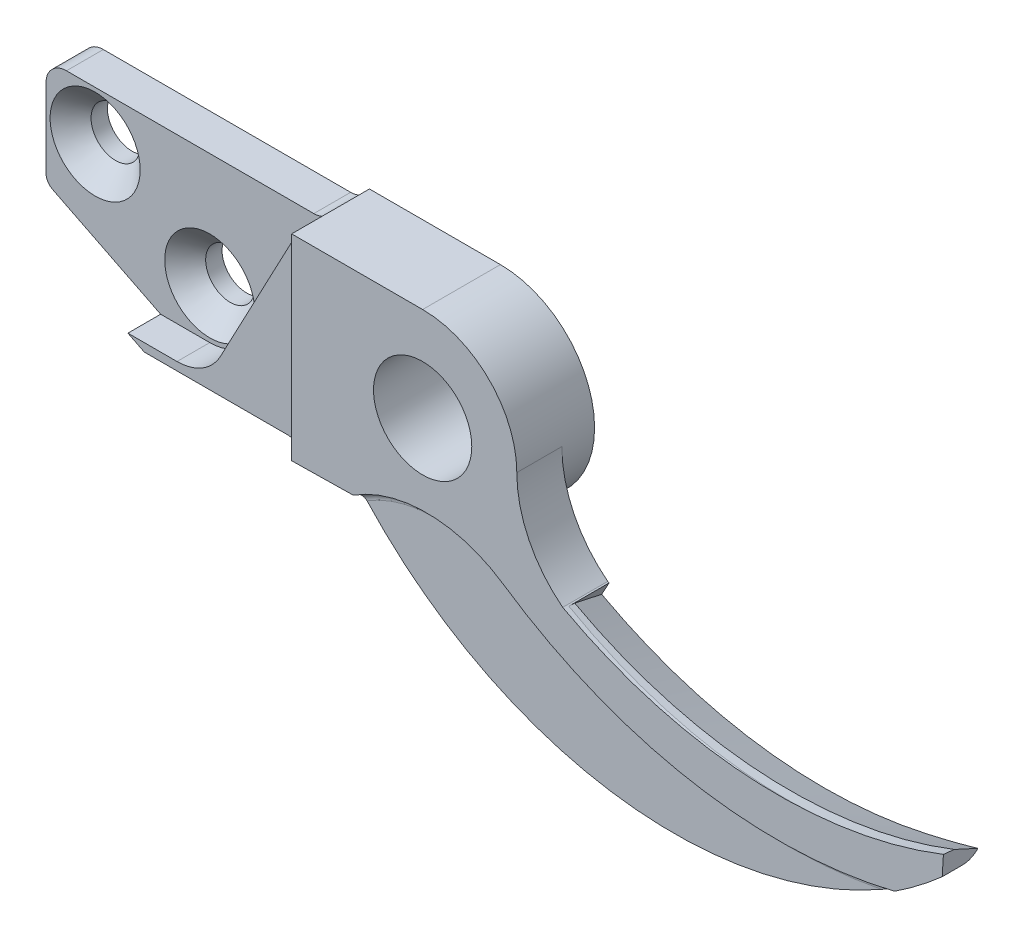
ISO-10303-21;
HEADER;
FILE_DESCRIPTION(('STEP AP214'),'2;1');
FILE_NAME('part.step','',(''),(''),'','','');
FILE_SCHEMA(('AUTOMOTIVE_DESIGN { 1 0 10303 214 1 1 1 1 }'));
ENDSEC;
DATA;
#1=APPLICATION_CONTEXT('core data for automotive mechanical design processes');
#2=APPLICATION_PROTOCOL_DEFINITION('international standard','automotive_design',2000,#1);
#3=PRODUCT_CONTEXT('',#1,'mechanical');
#4=PRODUCT('Part','Part','',(#3));
#5=PRODUCT_RELATED_PRODUCT_CATEGORY('part','',(#4));
#6=PRODUCT_DEFINITION_FORMATION('','',#4);
#7=PRODUCT_DEFINITION_CONTEXT('part definition',#1,'design');
#8=PRODUCT_DEFINITION('design','',#6,#7);
#9=PRODUCT_DEFINITION_SHAPE('','',#8);
#10=(LENGTH_UNIT() NAMED_UNIT(*) SI_UNIT(.MILLI.,.METRE.));
#11=(NAMED_UNIT(*) PLANE_ANGLE_UNIT() SI_UNIT($,.RADIAN.));
#12=(NAMED_UNIT(*) SI_UNIT($,.STERADIAN.) SOLID_ANGLE_UNIT());
#13=UNCERTAINTY_MEASURE_WITH_UNIT(LENGTH_MEASURE(1.E-05),#10,'distance_accuracy_value','');
#14=(GEOMETRIC_REPRESENTATION_CONTEXT(3) GLOBAL_UNCERTAINTY_ASSIGNED_CONTEXT((#13)) GLOBAL_UNIT_ASSIGNED_CONTEXT((#10,
#11,#12)) REPRESENTATION_CONTEXT('',''));
#15=CARTESIAN_POINT('',(0.,0.,0.));
#16=DIRECTION('',(0.,0.,1.));
#17=DIRECTION('',(1.,0.,0.));
#18=AXIS2_PLACEMENT_3D('',#15,#16,#17);
#19=CARTESIAN_POINT('',(51.,-10.,0.));
#20=DIRECTION('',(0.,0.,-1.));
#21=DIRECTION('',(-1.,0.,0.));
#22=AXIS2_PLACEMENT_3D('',#19,#20,#21);
#23=PLANE('',#22);
#24=CARTESIAN_POINT('',(20.,-14.,0.));
#25=DIRECTION('',(0.,0.,1.));
#26=DIRECTION('',(1.,0.,0.));
#27=AXIS2_PLACEMENT_3D('',#24,#25,#26);
#28=CIRCLE('',#27,3.);
#29=CARTESIAN_POINT('',(23.,-14.,0.));
#30=VERTEX_POINT('',#29);
#31=EDGE_CURVE('E507',#30,#30,#28,.T.);
#32=ORIENTED_EDGE('',*,*,#31,.T.);
#33=EDGE_LOOP('',(#32));
#34=FACE_BOUND('',#33,.T.);
#35=CARTESIAN_POINT('',(51.,-10.,0.));
#36=DIRECTION('',(0.,0.,1.));
#37=DIRECTION('',(1.,0.,0.));
#38=AXIS2_PLACEMENT_3D('',#35,#36,#37);
#39=CIRCLE('',#38,6.);
#40=CARTESIAN_POINT('',(57.,-10.,0.));
#41=VERTEX_POINT('',#40);
#42=EDGE_CURVE('E513',#41,#41,#39,.T.);
#43=ORIENTED_EDGE('',*,*,#42,.T.);
#44=EDGE_LOOP('',(#43));
#45=FACE_BOUND('',#44,.T.);
#46=CARTESIAN_POINT('',(6.,-6.,0.));
#47=DIRECTION('',(0.,0.,1.));
#48=DIRECTION('',(1.,0.,0.));
#49=AXIS2_PLACEMENT_3D('',#46,#47,#48);
#50=CIRCLE('',#49,3.);
#51=CARTESIAN_POINT('',(9.,-6.,0.));
#52=VERTEX_POINT('',#51);
#53=EDGE_CURVE('E510',#52,#52,#50,.T.);
#54=ORIENTED_EDGE('',*,*,#53,.T.);
#55=EDGE_LOOP('',(#54));
#56=FACE_BOUND('',#55,.T.);
#57=CARTESIAN_POINT('',(51.,-10.,0.));
#58=DIRECTION('',(0.,0.,-1.));
#59=DIRECTION('',(-1.,0.,0.));
#60=AXIS2_PLACEMENT_3D('',#57,#58,#59);
#61=CIRCLE('',#60,11.5);
#62=CARTESIAN_POINT('',(51.,1.5,0.));
#63=VERTEX_POINT('',#62);
#64=CARTESIAN_POINT('',(50.9999999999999,-21.5,0.));
#65=VERTEX_POINT('',#64);
#66=EDGE_CURVE('E525',#63,#65,#61,.T.);
#67=ORIENTED_EDGE('',*,*,#66,.T.);
#68=DIRECTION('',(-0.994688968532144,-0.102926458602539,0.));
#69=VECTOR('',#68,1.);
#70=CARTESIAN_POINT('',(50.9999999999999,-21.5,0.));
#71=LINE('',#70,#69);
#72=CARTESIAN_POINT('',(42.5257558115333,-22.376881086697,0.));
#73=VERTEX_POINT('',#72);
#74=EDGE_CURVE('E443',#65,#73,#71,.T.);
#75=ORIENTED_EDGE('',*,*,#74,.T.);
#76=DIRECTION('',(0.999866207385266,0.0163574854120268,0.));
#77=VECTOR('',#76,1.);
#78=CARTESIAN_POINT('',(35.,-22.5,0.));
#79=LINE('',#78,#77);
#80=CARTESIAN_POINT('',(35.,-22.5,0.));
#81=VERTEX_POINT('',#80);
#82=EDGE_CURVE('E527',#81,#73,#79,.T.);
#83=ORIENTED_EDGE('',*,*,#82,.F.);
#84=CARTESIAN_POINT('',(33.5,-22.5,0.));
#85=DIRECTION('',(0.,0.,-1.));
#86=DIRECTION('',(-1.,0.,0.));
#87=AXIS2_PLACEMENT_3D('',#84,#85,#86);
#88=CIRCLE('',#87,1.5);
#89=CARTESIAN_POINT('',(33.5,-21.,0.));
#90=VERTEX_POINT('',#89);
#91=EDGE_CURVE('E583',#81,#90,#88,.F.);
#92=ORIENTED_EDGE('',*,*,#91,.T.);
#93=DIRECTION('',(1.,0.,0.));
#94=VECTOR('',#93,1.);
#95=CARTESIAN_POINT('',(16.,-21.,0.));
#96=LINE('',#95,#94);
#97=CARTESIAN_POINT('',(16.,-21.,0.));
#98=VERTEX_POINT('',#97);
#99=EDGE_CURVE('E529',#98,#90,#96,.T.);
#100=ORIENTED_EDGE('',*,*,#99,.F.);
#101=DIRECTION('',(0.894427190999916,-0.447213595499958,0.));
#102=VECTOR('',#101,1.);
#103=CARTESIAN_POINT('',(0.,-13.,0.));
#104=LINE('',#103,#102);
#105=CARTESIAN_POINT('',(0.829179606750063,-13.414589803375,0.));
#106=VERTEX_POINT('',#105);
#107=EDGE_CURVE('E532',#106,#98,#104,.T.);
#108=ORIENTED_EDGE('',*,*,#107,.F.);
#109=CARTESIAN_POINT('',(1.5,-12.0729490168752,0.));
#110=DIRECTION('',(0.,0.,-1.));
#111=DIRECTION('',(-1.,0.,0.));
#112=AXIS2_PLACEMENT_3D('',#109,#110,#111);
#113=CIRCLE('',#112,1.5);
#114=CARTESIAN_POINT('',(0.,-12.0729490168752,0.));
#115=VERTEX_POINT('',#114);
#116=EDGE_CURVE('E574',#106,#115,#113,.T.);
#117=ORIENTED_EDGE('',*,*,#116,.T.);
#118=DIRECTION('',(0.,-1.,0.));
#119=VECTOR('',#118,1.);
#120=CARTESIAN_POINT('',(0.,0.,0.));
#121=LINE('',#120,#119);
#122=CARTESIAN_POINT('',(0.,-2.5,0.));
#123=VERTEX_POINT('',#122);
#124=EDGE_CURVE('E535',#123,#115,#121,.T.);
#125=ORIENTED_EDGE('',*,*,#124,.F.);
#126=CARTESIAN_POINT('',(2.5,-2.5,0.));
#127=DIRECTION('',(0.,0.,-1.));
#128=DIRECTION('',(-1.,0.,0.));
#129=AXIS2_PLACEMENT_3D('',#126,#127,#128);
#130=CIRCLE('',#129,2.5);
#131=CARTESIAN_POINT('',(2.5,0.,0.));
#132=VERTEX_POINT('',#131);
#133=EDGE_CURVE('E592',#123,#132,#130,.T.);
#134=ORIENTED_EDGE('',*,*,#133,.T.);
#135=DIRECTION('',(1.,0.,0.));
#136=VECTOR('',#135,1.);
#137=CARTESIAN_POINT('',(0.,0.,0.));
#138=LINE('',#137,#136);
#139=CARTESIAN_POINT('',(32.7087121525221,0.,0.));
#140=VERTEX_POINT('',#139);
#141=EDGE_CURVE('E519',#132,#140,#138,.T.);
#142=ORIENTED_EDGE('',*,*,#141,.T.);
#143=CARTESIAN_POINT('',(32.7087121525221,2.5,0.));
#144=DIRECTION('',(0.,0.,-1.));
#145=DIRECTION('',(-1.,0.,0.));
#146=AXIS2_PLACEMENT_3D('',#143,#144,#145);
#147=CIRCLE('',#146,2.5);
#148=CARTESIAN_POINT('',(35.,1.5,0.));
#149=VERTEX_POINT('',#148);
#150=EDGE_CURVE('E594',#140,#149,#147,.F.);
#151=ORIENTED_EDGE('',*,*,#150,.T.);
#152=DIRECTION('',(1.,0.,0.));
#153=VECTOR('',#152,1.);
#154=CARTESIAN_POINT('',(35.,1.5,0.));
#155=LINE('',#154,#153);
#156=EDGE_CURVE('E522',#149,#63,#155,.T.);
#157=ORIENTED_EDGE('',*,*,#156,.T.);
#158=EDGE_LOOP('',(#67,#75,#83,#92,#100,#108,#117,#125,#134,#142,#151,#157));
#159=FACE_BOUND('',#158,.T.);
#160=ADVANCED_FACE('F33',(#34,#45,#56,#159),#23,.T.);
#161=CARTESIAN_POINT('',(80.686573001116,11.3910763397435,9.5));
#162=DIRECTION('',(0.,0.,-1.));
#163=DIRECTION('',(-1.,0.,0.));
#164=AXIS2_PLACEMENT_3D('',#161,#162,#163);
#165=CYLINDRICAL_SURFACE('',#164,50.9560881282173);
#166=DIRECTION('',(0.,0.,-1.));
#167=VECTOR('',#166,1.);
#168=CARTESIAN_POINT('',(42.5257558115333,-22.376881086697,9.5));
#169=LINE('',#168,#167);
#170=CARTESIAN_POINT('',(42.5257558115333,-22.376881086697,9.5));
#171=VERTEX_POINT('',#170);
#172=CARTESIAN_POINT('',(42.5257558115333,-22.376881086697,7.));
#173=VERTEX_POINT('',#172);
#174=EDGE_CURVE('E437',#171,#173,#169,.T.);
#175=ORIENTED_EDGE('',*,*,#174,.T.);
#176=CARTESIAN_POINT('',(80.686573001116,11.3910763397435,7.));
#177=DIRECTION('',(0.,0.,-1.));
#178=DIRECTION('',(-1.,0.,0.));
#179=AXIS2_PLACEMENT_3D('',#176,#177,#178);
#180=CIRCLE('',#179,50.9560881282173);
#181=CARTESIAN_POINT('',(114.454530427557,-26.7697408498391,7.));
#182=VERTEX_POINT('',#181);
#183=EDGE_CURVE('E289',#173,#182,#180,.F.);
#184=ORIENTED_EDGE('',*,*,#183,.T.);
#185=DIRECTION('',(0.,0.,-1.));
#186=VECTOR('',#185,1.);
#187=CARTESIAN_POINT('',(114.454530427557,-26.7697408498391,9.5));
#188=LINE('',#187,#186);
#189=CARTESIAN_POINT('',(114.454530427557,-26.7697408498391,9.5));
#190=VERTEX_POINT('',#189);
#191=EDGE_CURVE('E562',#190,#182,#188,.T.);
#192=ORIENTED_EDGE('',*,*,#191,.F.);
#193=CARTESIAN_POINT('',(80.686573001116,11.3910763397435,9.5));
#194=DIRECTION('',(0.,0.,-1.));
#195=DIRECTION('',(-1.,0.,0.));
#196=AXIS2_PLACEMENT_3D('',#193,#194,#195);
#197=CIRCLE('',#196,50.9560881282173);
#198=CARTESIAN_POINT('',(108.634658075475,-31.2167569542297,9.5));
#199=VERTEX_POINT('',#198);
#200=EDGE_CURVE('E551',#190,#199,#197,.T.);
#201=ORIENTED_EDGE('',*,*,#200,.T.);
#202=CARTESIAN_POINT('',(108.634658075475,-31.2167569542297,9.5));
#203=CARTESIAN_POINT('',(108.634714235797,-31.2167196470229,9.47843093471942));
#204=CARTESIAN_POINT('',(108.632909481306,-31.2179039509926,9.45695704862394));
#205=CARTESIAN_POINT('',(108.626113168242,-31.2223609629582,9.41502720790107));
#206=CARTESIAN_POINT('',(108.621164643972,-31.225605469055,9.39456146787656));
#207=CARTESIAN_POINT('',(108.607015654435,-31.2348768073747,9.34989624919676));
#208=CARTESIAN_POINT('',(108.597060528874,-31.2413970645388,9.32604595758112));
#209=CARTESIAN_POINT('',(108.574078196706,-31.2564342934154,9.28046097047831));
#210=CARTESIAN_POINT('',(108.561034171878,-31.2649621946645,9.25873881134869));
#211=CARTESIAN_POINT('',(108.522780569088,-31.2899415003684,9.20269671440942));
#212=CARTESIAN_POINT('',(108.495514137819,-31.3077162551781,9.17039740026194));
#213=CARTESIAN_POINT('',(108.437493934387,-31.345448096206,9.11067472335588));
#214=CARTESIAN_POINT('',(108.406732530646,-31.3654099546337,9.08326238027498));
#215=CARTESIAN_POINT('',(108.330398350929,-31.4148185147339,9.02202612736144));
#216=CARTESIAN_POINT('',(108.283803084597,-31.4448783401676,8.98999217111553));
#217=CARTESIAN_POINT('',(108.188181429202,-31.5063327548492,8.93119315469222));
#218=CARTESIAN_POINT('',(108.139150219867,-31.5377299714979,8.90443910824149));
#219=CARTESIAN_POINT('',(108.039043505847,-31.6015838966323,8.85476946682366));
#220=CARTESIAN_POINT('',(107.987952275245,-31.6340481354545,8.83189570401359));
#221=CARTESIAN_POINT('',(107.884735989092,-31.6993701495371,8.78951503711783));
#222=CARTESIAN_POINT('',(107.832611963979,-31.7322275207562,8.77000494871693));
#223=CARTESIAN_POINT('',(107.708076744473,-31.8104106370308,8.72703233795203));
#224=CARTESIAN_POINT('',(107.635312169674,-31.8558404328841,8.70478813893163));
#225=CARTESIAN_POINT('',(107.48870109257,-31.9468550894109,8.664535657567));
#226=CARTESIAN_POINT('',(107.414854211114,-31.9924399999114,8.64652889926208));
#227=CARTESIAN_POINT('',(107.266196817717,-32.0836765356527,8.61410073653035));
#228=CARTESIAN_POINT('',(107.191384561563,-32.1293280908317,8.5996872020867));
#229=CARTESIAN_POINT('',(107.041123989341,-32.2204850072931,8.57406330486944));
#230=CARTESIAN_POINT('',(106.965675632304,-32.2659903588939,8.56285315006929));
#231=CARTESIAN_POINT('',(106.819097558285,-32.3538765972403,8.54396022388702));
#232=CARTESIAN_POINT('',(106.747999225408,-32.396271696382,8.53609811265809));
#233=CARTESIAN_POINT('',(106.605429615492,-32.4808128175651,8.52274859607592));
#234=CARTESIAN_POINT('',(106.533958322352,-32.5229588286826,8.51726129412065));
#235=CARTESIAN_POINT('',(106.391074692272,-32.6067455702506,8.50856337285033));
#236=CARTESIAN_POINT('',(106.319663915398,-32.6483877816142,8.50534127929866));
#237=CARTESIAN_POINT('',(106.176600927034,-32.7313469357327,8.50106307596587));
#238=CARTESIAN_POINT('',(106.104948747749,-32.7726639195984,8.50000668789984));
#239=CARTESIAN_POINT('',(106.033197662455,-32.8138050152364,8.5));
#240=B_SPLINE_CURVE_WITH_KNOTS('',3,(#202,#203,#204,#205,#206,#207,#208,#209,#210,#211,#212,
#213,#214,#215,#216,#217,#218,#219,#220,#221,#222,#223,#224,#225,#226,#227,#228,#229,#230,#231,
#232,#233,#234,#235,#236,#237,#238,#239),.UNSPECIFIED.,.F.,.F.,(4,2,2,2,2,2,2,2,2,2,2,2,2,2,2,2,
2,2,4),(0.,0.0644465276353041,0.128029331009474,0.207542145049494,0.287498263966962,
0.424288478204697,0.561383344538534,0.75303780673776,0.945087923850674,1.13909241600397,
1.33291222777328,1.59862608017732,1.86443535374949,2.13082179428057,2.39722552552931,
2.64664247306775,2.89607027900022,3.14422534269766,3.39234851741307),.UNSPECIFIED.);
#241=CARTESIAN_POINT('',(106.033197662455,-32.8138050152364,8.5));
#242=VERTEX_POINT('',#241);
#243=EDGE_CURVE('E307',#199,#242,#240,.T.);
#244=ORIENTED_EDGE('',*,*,#243,.T.);
#245=CARTESIAN_POINT('',(80.686573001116,11.3910763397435,8.5));
#246=DIRECTION('',(0.,0.,-1.));
#247=DIRECTION('',(-1.,0.,0.));
#248=AXIS2_PLACEMENT_3D('',#245,#246,#247);
#249=CIRCLE('',#248,50.9560881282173);
#250=CARTESIAN_POINT('',(43.2058910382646,-23.1302416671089,8.5));
#251=VERTEX_POINT('',#250);
#252=EDGE_CURVE('E425',#251,#242,#249,.F.);
#253=ORIENTED_EDGE('',*,*,#252,.F.);
#254=CARTESIAN_POINT('',(43.2058910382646,-23.1302416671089,8.5));
#255=CARTESIAN_POINT('',(43.1667412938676,-23.0877413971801,8.49995415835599));
#256=CARTESIAN_POINT('',(43.1276721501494,-23.0451724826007,8.50483232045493));
#257=CARTESIAN_POINT('',(43.0507737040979,-22.9611094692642,8.52414075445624));
#258=CARTESIAN_POINT('',(43.0129441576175,-22.9196151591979,8.5385691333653));
#259=CARTESIAN_POINT('',(42.9395591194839,-22.8388647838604,8.5766968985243));
#260=CARTESIAN_POINT('',(42.9040053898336,-22.7996104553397,8.60040336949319));
#261=CARTESIAN_POINT('',(42.8362304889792,-22.7245658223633,8.65644859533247));
#262=CARTESIAN_POINT('',(42.8040080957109,-22.6887742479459,8.68878416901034));
#263=CARTESIAN_POINT('',(42.7441177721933,-22.6220829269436,8.76085058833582));
#264=CARTESIAN_POINT('',(42.7164076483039,-22.5911379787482,8.80050451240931));
#265=CARTESIAN_POINT('',(42.6659513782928,-22.5346762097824,8.88632441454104));
#266=CARTESIAN_POINT('',(42.6432061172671,-22.5091603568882,8.93249155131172));
#267=CARTESIAN_POINT('',(42.6036354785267,-22.464701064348,9.02930868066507));
#268=CARTESIAN_POINT('',(42.5867311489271,-22.4456700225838,9.07988628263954));
#269=CARTESIAN_POINT('',(42.5588966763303,-22.414302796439,9.18461500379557));
#270=CARTESIAN_POINT('',(42.5479619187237,-22.4019614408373,9.23876332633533));
#271=CARTESIAN_POINT('',(42.5353747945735,-22.3877490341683,9.32775868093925));
#272=CARTESIAN_POINT('',(42.5317693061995,-22.383675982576,9.36200521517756));
#273=CARTESIAN_POINT('',(42.526960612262,-22.3782426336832,9.43082930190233));
#274=CARTESIAN_POINT('',(42.5257539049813,-22.3768783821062,9.46540629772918));
#275=CARTESIAN_POINT('',(42.5257558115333,-22.376881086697,9.5));
#276=B_SPLINE_CURVE_WITH_KNOTS('',3,(#254,#255,#256,#257,#258,#259,#260,#261,#262,#263,#264,
#265,#266,#267,#268,#269,#270,#271,#272,#273,#274,#275),.UNSPECIFIED.,.F.,.F.,(4,2,2,2,2,2,2,2,
2,2,4),(0.,0.173141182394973,0.346248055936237,0.519487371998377,0.6926629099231,
0.864112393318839,1.03559241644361,1.20465445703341,1.37358562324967,1.47743788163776,
1.58113842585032),.UNSPECIFIED.);
#277=EDGE_CURVE('E308',#251,#171,#276,.T.);
#278=ORIENTED_EDGE('',*,*,#277,.T.);
#279=EDGE_LOOP('',(#175,#184,#192,#201,#244,#253,#278));
#280=FACE_BOUND('',#279,.T.);
#281=ADVANCED_FACE('F326',(#280),#165,.T.);
#282=CARTESIAN_POINT('',(114.605751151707,-24.2936496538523,9.5));
#283=DIRECTION('',(0.998140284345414,-0.06095877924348,0.));
#284=DIRECTION('',(0.06095877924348,0.998140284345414,0.));
#285=AXIS2_PLACEMENT_3D('',#282,#283,#284);
#286=PLANE('',#285);
#287=CARTESIAN_POINT('',(114.603572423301,-24.3293241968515,9.50019999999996));
#288=CARTESIAN_POINT('',(114.602018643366,-24.3547658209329,9.27680078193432));
#289=CARTESIAN_POINT('',(114.600465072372,-24.3802040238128,9.05340117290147));
#290=CARTESIAN_POINT('',(114.597358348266,-24.4310735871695,8.60660117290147));
#291=CARTESIAN_POINT('',(114.595805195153,-24.4565049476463,8.38320078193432));
#292=CARTESIAN_POINT('',(114.594252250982,-24.4819328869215,8.15979999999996));
#293=B_SPLINE_CURVE_WITH_KNOTS('',3,(#287,#288,#289,#290,#291,#292),.UNSPECIFIED.,.F.,.F.,(4,2,
4),(0.,0.674545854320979,1.34909170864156),.UNSPECIFIED.);
#294=CARTESIAN_POINT('',(114.603571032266,-24.3293469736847,9.49999999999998));
#295=VERTEX_POINT('',#294);
#296=CARTESIAN_POINT('',(114.594253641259,-24.4819101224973,8.15999999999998));
#297=VERTEX_POINT('',#296);
#298=EDGE_CURVE('E233',#295,#297,#293,.T.);
#299=ORIENTED_EDGE('',*,*,#298,.F.);
#300=DIRECTION('',(-0.06095877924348,-0.998140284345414,0.));
#301=VECTOR('',#300,1.);
#302=CARTESIAN_POINT('',(114.605751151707,-24.2936496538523,9.5));
#303=LINE('',#302,#301);
#304=EDGE_CURVE('E549',#295,#190,#303,.T.);
#305=ORIENTED_EDGE('',*,*,#304,.T.);
#306=ORIENTED_EDGE('',*,*,#191,.T.);
#307=CARTESIAN_POINT('',(114.454530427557,-26.7697408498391,7.));
#308=CARTESIAN_POINT('',(114.454529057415,-26.7697632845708,6.93307899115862));
#309=CARTESIAN_POINT('',(114.454723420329,-26.7665807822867,6.86617009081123));
#310=CARTESIAN_POINT('',(114.455493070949,-26.7539785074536,6.73299214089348));
#311=CARTESIAN_POINT('',(114.45606807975,-26.7445633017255,6.6667226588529));
#312=CARTESIAN_POINT('',(114.457582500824,-26.7197661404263,6.53585874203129));
#313=CARTESIAN_POINT('',(114.458518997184,-26.7044319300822,6.47125520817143));
#314=CARTESIAN_POINT('',(114.460737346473,-26.6681086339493,6.34367644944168));
#315=CARTESIAN_POINT('',(114.462019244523,-26.6471188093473,6.2807014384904));
#316=CARTESIAN_POINT('',(114.466342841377,-26.5763241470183,6.09518667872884));
#317=CARTESIAN_POINT('',(114.4698679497,-26.5186039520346,5.9756004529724));
#318=CARTESIAN_POINT('',(114.477996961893,-26.3854993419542,5.7467426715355));
#319=CARTESIAN_POINT('',(114.48260261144,-26.3100863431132,5.63748821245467));
#320=CARTESIAN_POINT('',(114.494661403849,-26.1126354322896,5.38968279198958));
#321=CARTESIAN_POINT('',(114.502522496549,-25.9839177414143,5.25647620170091));
#322=CARTESIAN_POINT('',(114.519465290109,-25.7064960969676,5.01215297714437));
#323=CARTESIAN_POINT('',(114.528551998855,-25.5577101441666,4.90113187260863));
#324=CARTESIAN_POINT('',(114.543327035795,-25.3157833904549,4.74521578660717));
#325=CARTESIAN_POINT('',(114.548731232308,-25.2272949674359,4.6928588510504));
#326=CARTESIAN_POINT('',(114.559752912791,-25.0468257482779,4.59447929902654));
#327=CARTESIAN_POINT('',(114.565370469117,-24.954843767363,4.54845885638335));
#328=CARTESIAN_POINT('',(114.576710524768,-24.7691614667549,4.46300226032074));
#329=CARTESIAN_POINT('',(114.582431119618,-24.6754923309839,4.42349754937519));
#330=CARTESIAN_POINT('',(114.594001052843,-24.4860460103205,4.35023300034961));
#331=CARTESIAN_POINT('',(114.599850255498,-24.3902710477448,4.31646740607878));
#332=CARTESIAN_POINT('',(114.605751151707,-24.2936496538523,4.28542365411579));
#333=B_SPLINE_CURVE_WITH_KNOTS('',3,(#307,#308,#309,#310,#311,#312,#313,#314,#315,#316,#317,
#318,#319,#320,#321,#322,#323,#324,#325,#326,#327,#328,#329,#330,#331,#332),.UNSPECIFIED.,.F.,
.F.,(4,2,2,2,2,2,2,2,2,2,2,2,4),(0.,0.200667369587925,0.401187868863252,0.600123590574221,
0.799085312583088,1.19563078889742,1.59282137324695,2.1459930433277,2.70149761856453,
3.01015668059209,3.31892137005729,3.62419526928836,3.92916115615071),.UNSPECIFIED.);
#334=CARTESIAN_POINT('',(114.507832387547,-25.8969734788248,5.18083695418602));
#335=VERTEX_POINT('',#334);
#336=EDGE_CURVE('E282',#182,#335,#333,.T.);
#337=ORIENTED_EDGE('',*,*,#336,.T.);
#338=CARTESIAN_POINT('',(114.594259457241,-24.4818148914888,8.16019999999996));
#339=CARTESIAN_POINT('',(114.575490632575,-24.7891360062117,7.5147418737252));
#340=CARTESIAN_POINT('',(114.556745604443,-25.0960674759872,6.86909811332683));
#341=CARTESIAN_POINT('',(114.519303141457,-25.7091511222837,5.57743933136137));
#342=CARTESIAN_POINT('',(114.5006057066,-26.0153032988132,4.93142430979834));
#343=CARTESIAN_POINT('',(114.481932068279,-26.3210658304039,4.28522365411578));
#344=B_SPLINE_CURVE_WITH_KNOTS('',3,(#338,#339,#340,#341,#342,#343),.UNSPECIFIED.,.F.,.F.,(4,2,
4),(0.,2.14539682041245,4.29079361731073),.UNSPECIFIED.);
#345=EDGE_CURVE('E48',#297,#335,#344,.T.);
#346=ORIENTED_EDGE('',*,*,#345,.F.);
#347=EDGE_LOOP('',(#299,#305,#306,#337,#346));
#348=FACE_BOUND('',#347,.T.);
#349=ADVANCED_FACE('F250',(#348),#286,.T.);
#350=CARTESIAN_POINT('',(94.3893249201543,26.7745839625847,9.5));
#351=DIRECTION('',(0.,0.,-1.));
#352=DIRECTION('',(-1.,0.,0.));
#353=AXIS2_PLACEMENT_3D('',#350,#351,#352);
#354=CYLINDRICAL_SURFACE('',#353,54.9242057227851);
#355=CARTESIAN_POINT('',(57.351409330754,-13.782304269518,8.69836233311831));
#356=CARTESIAN_POINT('',(58.174179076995,-14.5337438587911,8.71436957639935));
#357=CARTESIAN_POINT('',(59.0198585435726,-15.2600687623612,8.73082326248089));
#358=CARTESIAN_POINT('',(60.7536388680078,-16.6598362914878,8.76455763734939));
#359=CARTESIAN_POINT('',(61.6417320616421,-17.3332884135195,8.7818381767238));
#360=CARTESIAN_POINT('',(63.4590194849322,-18.6261955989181,8.81720080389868));
#361=CARTESIAN_POINT('',(64.3882908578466,-19.2455422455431,8.8352843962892));
#362=CARTESIAN_POINT('',(66.2829391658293,-20.4265387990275,8.87215615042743));
#363=CARTESIAN_POINT('',(67.2483223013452,-20.9881787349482,8.8909444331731));
#364=CARTESIAN_POINT('',(69.5882939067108,-22.2556362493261,8.93648745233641));
#365=CARTESIAN_POINT('',(70.9778018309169,-22.9341185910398,8.9635335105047));
#366=CARTESIAN_POINT('',(73.8092945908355,-24.1716523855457,9.01865143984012));
#367=CARTESIAN_POINT('',(75.2512922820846,-24.730674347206,9.04672356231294));
#368=CARTESIAN_POINT('',(78.1761078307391,-25.7247857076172,9.1036671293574));
#369=CARTESIAN_POINT('',(79.6588927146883,-26.1599721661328,9.13253792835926));
#370=CARTESIAN_POINT('',(82.6555683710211,-26.9038057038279,9.19089004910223));
#371=CARTESIAN_POINT('',(84.1694509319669,-27.2124857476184,9.22037120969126));
#372=CARTESIAN_POINT('',(86.7533066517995,-27.626818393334,9.27069314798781));
#373=CARTESIAN_POINT('',(87.8180828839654,-27.7656719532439,9.29143142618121));
#374=CARTESIAN_POINT('',(89.9541310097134,-27.9807769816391,9.33303694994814));
#375=CARTESIAN_POINT('',(91.0254037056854,-28.057020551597,9.35390421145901));
#376=CARTESIAN_POINT('',(93.1706780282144,-28.1465953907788,9.39569436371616));
#377=CARTESIAN_POINT('',(94.2446799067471,-28.15992062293,9.41661725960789));
#378=CARTESIAN_POINT('',(96.3914271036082,-28.1236176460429,9.45844104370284));
#379=CARTESIAN_POINT('',(97.4641725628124,-28.0739973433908,9.47934193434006));
#380=CARTESIAN_POINT('',(100.073943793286,-27.8764497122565,9.53019254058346));
#381=CARTESIAN_POINT('',(101.608555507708,-27.6949868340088,9.56009653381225));
#382=CARTESIAN_POINT('',(104.657364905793,-27.2033849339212,9.61951169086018));
#383=CARTESIAN_POINT('',(106.171556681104,-26.8932094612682,9.64902274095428));
#384=CARTESIAN_POINT('',(109.169045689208,-26.1462532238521,9.70744750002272));
#385=CARTESIAN_POINT('',(110.652329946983,-25.7094203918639,9.7363609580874));
#386=CARTESIAN_POINT('',(113.576462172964,-24.7123735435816,9.79336520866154));
#387=CARTESIAN_POINT('',(115.017324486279,-24.1522017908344,9.82145627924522));
#388=CARTESIAN_POINT('',(117.257241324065,-23.1707832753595,9.86512907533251));
#389=CARTESIAN_POINT('',(118.073731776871,-22.7888058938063,9.8810493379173));
#390=CARTESIAN_POINT('',(119.686922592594,-21.9851502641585,9.91250537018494));
#391=CARTESIAN_POINT('',(120.483624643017,-21.5634754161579,9.92804117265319));
#392=CARTESIAN_POINT('',(122.053443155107,-20.6824817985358,9.95865416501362));
#393=CARTESIAN_POINT('',(122.826611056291,-20.2232546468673,9.97373235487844));
#394=CARTESIAN_POINT('',(124.349655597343,-19.2673100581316,10.0034357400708));
#395=CARTESIAN_POINT('',(125.099527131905,-18.7705844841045,10.0180608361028));
#396=CARTESIAN_POINT('',(125.836745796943,-18.2557179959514,10.0324397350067));
#397=B_SPLINE_CURVE_WITH_KNOTS('',3,(#355,#356,#357,#358,#359,#360,#361,#362,#363,#364,#365,
#366,#367,#368,#369,#370,#371,#372,#373,#374,#375,#376,#377,#378,#379,#380,#381,#382,#383,#384,
#385,#386,#387,#388,#389,#390,#391,#392,#393,#394,#395,#396),.UNSPECIFIED.,.F.,.F.,(4,2,2,2,2,2,
2,2,2,2,2,2,2,2,2,2,2,2,2,2,4),(0.,3.34263387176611,6.68466599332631,10.0332482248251,
13.3824080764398,18.0162711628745,22.651276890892,27.2826397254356,31.9127949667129,
35.1330701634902,38.3537515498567,41.5747419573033,44.7953278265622,49.4263206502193,
54.0586258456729,58.6928380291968,63.3254647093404,66.0292049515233,68.7327138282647,
71.4298131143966,74.1274993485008),.UNSPECIFIED.);
#398=CARTESIAN_POINT('',(68.2672766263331,-21.5400822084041,8.91077640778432));
#399=VERTEX_POINT('',#398);
#400=CARTESIAN_POINT('',(98.524392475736,-27.9937425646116,9.5));
#401=VERTEX_POINT('',#400);
#402=EDGE_CURVE('E674',#399,#401,#397,.T.);
#403=ORIENTED_EDGE('',*,*,#402,.F.);
#404=DIRECTION('',(0.,0.,-1.));
#405=VECTOR('',#404,1.);
#406=CARTESIAN_POINT('',(68.2672766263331,-21.5400822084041,9.5));
#407=LINE('',#406,#405);
#408=CARTESIAN_POINT('',(68.2672766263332,-21.5400822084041,3.99999999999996));
#409=VERTEX_POINT('',#408);
#410=EDGE_CURVE('E226',#409,#399,#407,.F.);
#411=ORIENTED_EDGE('',*,*,#410,.F.);
#412=CARTESIAN_POINT('',(94.3893249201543,26.7745839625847,4.));
#413=DIRECTION('',(0.,0.,-1.));
#414=DIRECTION('',(-1.,0.,0.));
#415=AXIS2_PLACEMENT_3D('',#412,#413,#414);
#416=CIRCLE('',#415,54.9242057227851);
#417=CARTESIAN_POINT('',(68.1086105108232,-21.4539597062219,4.));
#418=VERTEX_POINT('',#417);
#419=EDGE_CURVE('E460',#409,#418,#416,.T.);
#420=ORIENTED_EDGE('',*,*,#419,.T.);
#421=DIRECTION('',(0.,0.,-1.));
#422=VECTOR('',#421,1.);
#423=CARTESIAN_POINT('',(68.1086105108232,-21.4539597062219,9.5));
#424=LINE('',#423,#422);
#425=CARTESIAN_POINT('',(68.1086105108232,-21.4539597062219,9.5));
#426=VERTEX_POINT('',#425);
#427=EDGE_CURVE('E564',#426,#418,#424,.T.);
#428=ORIENTED_EDGE('',*,*,#427,.F.);
#429=CARTESIAN_POINT('',(94.3893249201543,26.7745839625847,9.5));
#430=DIRECTION('',(0.,0.,1.));
#431=DIRECTION('',(1.,0.,0.));
#432=AXIS2_PLACEMENT_3D('',#429,#430,#431);
#433=CIRCLE('',#432,54.9242057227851);
#434=EDGE_CURVE('E546',#426,#401,#433,.T.);
#435=ORIENTED_EDGE('',*,*,#434,.T.);
#436=EDGE_LOOP('',(#403,#411,#420,#428,#435));
#437=FACE_BOUND('',#436,.T.);
#438=ADVANCED_FACE('F672',(#437),#354,.F.);
#439=CARTESIAN_POINT('',(77.,-10.,9.5));
#440=DIRECTION('',(0.,0.,-1.));
#441=DIRECTION('',(-1.,0.,0.));
#442=AXIS2_PLACEMENT_3D('',#439,#440,#441);
#443=CYLINDRICAL_SURFACE('',#442,14.5);
#444=ORIENTED_EDGE('',*,*,#427,.T.);
#445=CARTESIAN_POINT('',(77.,-10.,4.));
#446=DIRECTION('',(0.,0.,-1.));
#447=DIRECTION('',(-1.,0.,0.));
#448=AXIS2_PLACEMENT_3D('',#445,#446,#447);
#449=CIRCLE('',#448,14.5);
#450=CARTESIAN_POINT('',(62.5,-10.,4.));
#451=VERTEX_POINT('',#450);
#452=EDGE_CURVE('E457',#418,#451,#449,.T.);
#453=ORIENTED_EDGE('',*,*,#452,.T.);
#454=DIRECTION('',(0.,0.,-1.));
#455=VECTOR('',#454,1.);
#456=CARTESIAN_POINT('',(62.5,-10.,9.5));
#457=LINE('',#456,#455);
#458=CARTESIAN_POINT('',(62.5,-10.,9.5));
#459=VERTEX_POINT('',#458);
#460=EDGE_CURVE('E567',#459,#451,#457,.T.);
#461=ORIENTED_EDGE('',*,*,#460,.F.);
#462=CARTESIAN_POINT('',(77.,-10.,9.5));
#463=DIRECTION('',(0.,0.,1.));
#464=DIRECTION('',(1.,0.,0.));
#465=AXIS2_PLACEMENT_3D('',#462,#463,#464);
#466=CIRCLE('',#465,14.5);
#467=EDGE_CURVE('E543',#459,#426,#466,.T.);
#468=ORIENTED_EDGE('',*,*,#467,.T.);
#469=EDGE_LOOP('',(#444,#453,#461,#468));
#470=FACE_BOUND('',#469,.T.);
#471=ADVANCED_FACE('F353',(#470),#443,.F.);
#472=CARTESIAN_POINT('',(51.,-10.,9.5));
#473=DIRECTION('',(0.,0.,-1.));
#474=DIRECTION('',(-1.,0.,0.));
#475=AXIS2_PLACEMENT_3D('',#472,#473,#474);
#476=PLANE('',#475);
#477=CARTESIAN_POINT('',(51.,-10.,9.5));
#478=DIRECTION('',(0.,0.,1.));
#479=DIRECTION('',(1.,0.,0.));
#480=AXIS2_PLACEMENT_3D('',#477,#478,#479);
#481=CIRCLE('',#480,6.);
#482=CARTESIAN_POINT('',(57.,-10.,9.5));
#483=VERTEX_POINT('',#482);
#484=EDGE_CURVE('E516',#483,#483,#481,.T.);
#485=ORIENTED_EDGE('',*,*,#484,.F.);
#486=EDGE_LOOP('',(#485));
#487=FACE_BOUND('',#486,.T.);
#488=ORIENTED_EDGE('',*,*,#304,.F.);
#489=CARTESIAN_POINT('',(94.5,26.7745839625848,9.5));
#490=DIRECTION('',(0.,0.,-1.));
#491=DIRECTION('',(-1.,0.,0.));
#492=AXIS2_PLACEMENT_3D('',#489,#490,#491);
#493=CIRCLE('',#492,54.9159842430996);
#494=EDGE_CURVE('E11',#295,#401,#493,.T.);
#495=ORIENTED_EDGE('',*,*,#494,.T.);
#496=ORIENTED_EDGE('',*,*,#434,.F.);
#497=ORIENTED_EDGE('',*,*,#467,.F.);
#498=CARTESIAN_POINT('',(51.,-10.,9.5));
#499=DIRECTION('',(0.,0.,-1.));
#500=DIRECTION('',(-1.,0.,0.));
#501=AXIS2_PLACEMENT_3D('',#498,#499,#500);
#502=CIRCLE('',#501,11.5);
#503=CARTESIAN_POINT('',(51.,1.5,9.5));
#504=VERTEX_POINT('',#503);
#505=EDGE_CURVE('E540',#504,#459,#502,.T.);
#506=ORIENTED_EDGE('',*,*,#505,.F.);
#507=DIRECTION('',(1.,0.,0.));
#508=VECTOR('',#507,1.);
#509=CARTESIAN_POINT('',(35.,1.5,9.5));
#510=LINE('',#509,#508);
#511=CARTESIAN_POINT('',(35.,1.5,9.5));
#512=VERTEX_POINT('',#511);
#513=EDGE_CURVE('E537',#512,#504,#510,.T.);
#514=ORIENTED_EDGE('',*,*,#513,.F.);
#515=DIRECTION('',(0.,-1.,0.));
#516=VECTOR('',#515,1.);
#517=CARTESIAN_POINT('',(35.,1.5,9.5));
#518=LINE('',#517,#516);
#519=CARTESIAN_POINT('',(35.,-22.5,9.5));
#520=VERTEX_POINT('',#519);
#521=EDGE_CURVE('E462',#512,#520,#518,.T.);
#522=ORIENTED_EDGE('',*,*,#521,.T.);
#523=DIRECTION('',(0.999866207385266,0.0163574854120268,0.));
#524=VECTOR('',#523,1.);
#525=CARTESIAN_POINT('',(35.,-22.5,9.5));
#526=LINE('',#525,#524);
#527=EDGE_CURVE('E553',#520,#171,#526,.T.);
#528=ORIENTED_EDGE('',*,*,#527,.T.);
#529=CARTESIAN_POINT('',(51.4936795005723,-36.437265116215,9.5));
#530=DIRECTION('',(0.,0.,1.));
#531=DIRECTION('',(1.,0.,0.));
#532=AXIS2_PLACEMENT_3D('',#529,#530,#531);
#533=CIRCLE('',#532,16.6768718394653);
#534=CARTESIAN_POINT('',(60.8580493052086,-22.6377494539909,9.5));
#535=VERTEX_POINT('',#534);
#536=EDGE_CURVE('E438',#535,#171,#533,.T.);
#537=ORIENTED_EDGE('',*,*,#536,.F.);
#538=CARTESIAN_POINT('',(94.3893249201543,26.7745839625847,9.5));
#539=DIRECTION('',(0.,0.,-1.));
#540=DIRECTION('',(-1.,0.,0.));
#541=AXIS2_PLACEMENT_3D('',#538,#539,#540);
#542=CIRCLE('',#541,59.7153676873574);
#543=EDGE_CURVE('E423',#535,#199,#542,.F.);
#544=ORIENTED_EDGE('',*,*,#543,.T.);
#545=ORIENTED_EDGE('',*,*,#200,.F.);
#546=EDGE_LOOP('',(#488,#495,#496,#497,#506,#514,#522,#528,#537,#544,#545));
#547=FACE_BOUND('',#546,.T.);
#548=ADVANCED_FACE('F344',(#487,#547),#476,.F.);
#549=CARTESIAN_POINT('',(0.,-13.,9.5));
#550=DIRECTION('',(0.447213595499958,0.894427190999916,0.));
#551=DIRECTION('',(-0.894427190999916,0.447213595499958,0.));
#552=AXIS2_PLACEMENT_3D('',#549,#550,#551);
#553=PLANE('',#552);
#554=DIRECTION('',(0.894427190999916,-0.447213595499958,0.));
#555=VECTOR('',#554,1.);
#556=CARTESIAN_POINT('',(0.,-13.,8.5));
#557=LINE('',#556,#555);
#558=CARTESIAN_POINT('',(14.0000000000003,-20.0000000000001,8.5));
#559=VERTEX_POINT('',#558);
#560=CARTESIAN_POINT('',(16.,-21.,8.5));
#561=VERTEX_POINT('',#560);
#562=EDGE_CURVE('E469',#559,#561,#557,.T.);
#563=ORIENTED_EDGE('',*,*,#562,.F.);
#564=DIRECTION('',(0.,0.,1.));
#565=VECTOR('',#564,1.);
#566=CARTESIAN_POINT('',(14.0000000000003,-20.0000000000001,4.5));
#567=LINE('',#566,#565);
#568=CARTESIAN_POINT('',(14.0000000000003,-20.0000000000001,4.5));
#569=VERTEX_POINT('',#568);
#570=EDGE_CURVE('E493',#569,#559,#567,.T.);
#571=ORIENTED_EDGE('',*,*,#570,.F.);
#572=DIRECTION('',(0.894427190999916,-0.447213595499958,0.));
#573=VECTOR('',#572,1.);
#574=CARTESIAN_POINT('',(0.,-13.,4.5));
#575=LINE('',#574,#573);
#576=CARTESIAN_POINT('',(0.829179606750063,-13.414589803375,4.5));
#577=VERTEX_POINT('',#576);
#578=EDGE_CURVE('E505',#577,#569,#575,.T.);
#579=ORIENTED_EDGE('',*,*,#578,.F.);
#580=DIRECTION('',(0.,0.,-1.));
#581=VECTOR('',#580,1.);
#582=CARTESIAN_POINT('',(0.829179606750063,-13.414589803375,9.5));
#583=LINE('',#582,#581);
#584=EDGE_CURVE('E558',#577,#106,#583,.T.);
#585=ORIENTED_EDGE('',*,*,#584,.T.);
#586=ORIENTED_EDGE('',*,*,#107,.T.);
#587=DIRECTION('',(0.,0.,-1.));
#588=VECTOR('',#587,1.);
#589=CARTESIAN_POINT('',(16.,-21.,9.5));
#590=LINE('',#589,#588);
#591=EDGE_CURVE('E556',#561,#98,#590,.T.);
#592=ORIENTED_EDGE('',*,*,#591,.F.);
#593=EDGE_LOOP('',(#563,#571,#579,#585,#586,#592));
#594=FACE_BOUND('',#593,.T.);
#595=ADVANCED_FACE('F340',(#594),#553,.F.);
#596=CARTESIAN_POINT('',(16.,-21.,9.5));
#597=DIRECTION('',(0.,1.,0.));
#598=DIRECTION('',(0.,0.,1.));
#599=AXIS2_PLACEMENT_3D('',#596,#597,#598);
#600=PLANE('',#599);
#601=DIRECTION('',(1.,0.,0.));
#602=VECTOR('',#601,1.);
#603=CARTESIAN_POINT('',(16.,-21.,8.5));
#604=LINE('',#603,#602);
#605=CARTESIAN_POINT('',(33.5,-21.,8.5));
#606=VERTEX_POINT('',#605);
#607=EDGE_CURVE('E471',#561,#606,#604,.T.);
#608=ORIENTED_EDGE('',*,*,#607,.F.);
#609=ORIENTED_EDGE('',*,*,#591,.T.);
#610=ORIENTED_EDGE('',*,*,#99,.T.);
#611=DIRECTION('',(0.,0.,-1.));
#612=VECTOR('',#611,1.);
#613=CARTESIAN_POINT('',(33.5,-21.,9.5));
#614=LINE('',#613,#612);
#615=EDGE_CURVE('E580',#90,#606,#614,.F.);
#616=ORIENTED_EDGE('',*,*,#615,.T.);
#617=EDGE_LOOP('',(#608,#609,#610,#616));
#618=FACE_BOUND('',#617,.T.);
#619=ADVANCED_FACE('F336',(#618),#600,.F.);
#620=CARTESIAN_POINT('',(33.5,-22.5,9.5));
#621=DIRECTION('',(0.,0.,1.));
#622=DIRECTION('',(1.,0.,0.));
#623=AXIS2_PLACEMENT_3D('',#620,#621,#622);
#624=CYLINDRICAL_SURFACE('',#623,1.5);
#625=CARTESIAN_POINT('',(33.5,-22.5,8.5));
#626=DIRECTION('',(0.,0.,1.));
#627=DIRECTION('',(1.,0.,0.));
#628=AXIS2_PLACEMENT_3D('',#625,#626,#627);
#629=CIRCLE('',#628,1.5);
#630=CARTESIAN_POINT('',(34.,-21.0857864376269,8.5));
#631=VERTEX_POINT('',#630);
#632=EDGE_CURVE('E473',#606,#631,#629,.F.);
#633=ORIENTED_EDGE('',*,*,#632,.F.);
#634=ORIENTED_EDGE('',*,*,#615,.F.);
#635=ORIENTED_EDGE('',*,*,#91,.F.);
#636=DIRECTION('',(0.,0.,-1.));
#637=VECTOR('',#636,1.);
#638=CARTESIAN_POINT('',(35.,-22.5,9.5));
#639=LINE('',#638,#637);
#640=EDGE_CURVE('E559',#520,#81,#639,.T.);
#641=ORIENTED_EDGE('',*,*,#640,.F.);
#642=CARTESIAN_POINT('',(34.,-21.0857864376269,8.5));
#643=CARTESIAN_POINT('',(34.0281970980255,-21.0957504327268,8.4999975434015));
#644=CARTESIAN_POINT('',(34.0560680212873,-21.1065585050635,8.50119261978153));
#645=CARTESIAN_POINT('',(34.1109230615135,-21.1297244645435,8.50579107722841));
#646=CARTESIAN_POINT('',(34.1379084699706,-21.1420799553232,8.50919107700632));
#647=CARTESIAN_POINT('',(34.2167468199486,-21.1810302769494,8.52233054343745));
#648=CARTESIAN_POINT('',(34.2670931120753,-21.2097276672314,8.53501778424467));
#649=CARTESIAN_POINT('',(34.3736101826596,-21.2786463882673,8.57034908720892));
#650=CARTESIAN_POINT('',(34.428490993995,-21.3200033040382,8.59460395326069));
#651=CARTESIAN_POINT('',(34.5303152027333,-21.4077558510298,8.65020637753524));
#652=CARTESIAN_POINT('',(34.5772217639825,-21.454173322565,8.68158536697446));
#653=CARTESIAN_POINT('',(34.6796364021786,-21.569158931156,8.76253604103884));
#654=CARTESIAN_POINT('',(34.731454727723,-21.6393507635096,8.81445015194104));
#655=CARTESIAN_POINT('',(34.8207616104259,-21.7838829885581,8.92435023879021));
#656=CARTESIAN_POINT('',(34.8582302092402,-21.8582289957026,8.98234452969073));
#657=CARTESIAN_POINT('',(34.9262046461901,-22.0249867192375,9.11433616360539));
#658=CARTESIAN_POINT('',(34.9536817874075,-22.1179625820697,9.18916755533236));
#659=CARTESIAN_POINT('',(34.9903654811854,-22.3053349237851,9.34106624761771));
#660=CARTESIAN_POINT('',(34.9996113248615,-22.3997279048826,9.41812837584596));
#661=CARTESIAN_POINT('',(34.9999959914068,-22.4960000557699,9.49673406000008));
#662=CARTESIAN_POINT('',(34.999999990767,-22.4980000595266,9.49836705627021));
#663=CARTESIAN_POINT('',(35.,-22.5,9.5));
#664=B_SPLINE_CURVE_WITH_KNOTS('',3,(#642,#643,#644,#645,#646,#647,#648,#649,#650,#651,#652,
#653,#654,#655,#656,#657,#658,#659,#660,#661,#662,#663),.UNSPECIFIED.,.F.,.F.,(4,2,2,2,2,2,2,2,
2,2,4),(0.,0.0896361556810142,0.179135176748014,0.356215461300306,0.573677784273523,
0.792118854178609,1.09504447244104,1.3983898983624,1.76428338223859,2.12938744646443,
2.13713342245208),.UNSPECIFIED.);
#665=EDGE_CURVE('E383',#520,#631,#664,.F.);
#666=ORIENTED_EDGE('',*,*,#665,.T.);
#667=EDGE_LOOP('',(#633,#634,#635,#641,#666));
#668=FACE_BOUND('',#667,.T.);
#669=ADVANCED_FACE('F339',(#668),#624,.F.);
#670=CARTESIAN_POINT('',(32.7087121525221,2.5,9.5));
#671=DIRECTION('',(0.,0.,-1.));
#672=DIRECTION('',(-1.,0.,0.));
#673=AXIS2_PLACEMENT_3D('',#670,#671,#672);
#674=CYLINDRICAL_SURFACE('',#673,2.5);
#675=DIRECTION('',(0.,0.,-1.));
#676=VECTOR('',#675,1.);
#677=CARTESIAN_POINT('',(34.8232277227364,1.16627442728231,9.5));
#678=LINE('',#677,#676);
#679=CARTESIAN_POINT('',(34.8232277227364,1.16627442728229,4.5));
#680=VERTEX_POINT('',#679);
#681=CARTESIAN_POINT('',(34.8232277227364,1.16627442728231,8.93228870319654));
#682=VERTEX_POINT('',#681);
#683=EDGE_CURVE('E600',#680,#682,#678,.F.);
#684=ORIENTED_EDGE('',*,*,#683,.T.);
#685=CARTESIAN_POINT('',(34.8232277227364,1.16627442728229,8.93228870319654));
#686=CARTESIAN_POINT('',(34.8353176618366,1.18543583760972,8.94983260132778));
#687=CARTESIAN_POINT('',(34.8469420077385,1.20444885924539,8.96787644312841));
#688=CARTESIAN_POINT('',(34.8692457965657,1.24199825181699,9.00513794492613));
#689=CARTESIAN_POINT('',(34.8799223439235,1.26053304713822,9.02435891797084));
#690=CARTESIAN_POINT('',(34.9005876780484,1.29744247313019,9.0647159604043));
#691=CARTESIAN_POINT('',(34.9105410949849,1.31579058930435,9.08589476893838));
#692=CARTESIAN_POINT('',(34.9292367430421,1.3512307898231,9.12974720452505));
#693=CARTESIAN_POINT('',(34.9379805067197,1.36832445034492,9.15241888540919));
#694=CARTESIAN_POINT('',(34.9544177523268,1.4012924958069,9.20041059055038));
#695=CARTESIAN_POINT('',(34.9620588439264,1.41709607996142,9.22579843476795));
#696=CARTESIAN_POINT('',(34.9755006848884,1.44552757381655,9.27835566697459));
#697=CARTESIAN_POINT('',(34.9813239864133,1.45819396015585,9.30549772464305));
#698=CARTESIAN_POINT('',(34.990465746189,1.47837319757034,9.35976141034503));
#699=CARTESIAN_POINT('',(34.9939385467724,1.48619978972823,9.38673378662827));
#700=CARTESIAN_POINT('',(34.9987480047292,1.49712603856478,9.44238162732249));
#701=CARTESIAN_POINT('',(35.0000368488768,1.50011982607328,9.47108130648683));
#702=CARTESIAN_POINT('',(35.,1.49999999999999,9.50000000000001));
#703=B_SPLINE_CURVE_WITH_KNOTS('',3,(#685,#686,#687,#688,#689,#690,#691,#692,#693,#694,#695,
#696,#697,#698,#699,#700,#701,#702),.UNSPECIFIED.,.F.,.F.,(4,2,2,2,2,2,2,2,4),(0.,
0.085972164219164,0.172198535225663,0.261334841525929,0.350357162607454,0.442754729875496,
0.533955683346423,0.618359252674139,0.704587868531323),.UNSPECIFIED.);
#704=EDGE_CURVE('E405',#682,#512,#703,.T.);
#705=ORIENTED_EDGE('',*,*,#704,.T.);
#706=DIRECTION('',(0.,0.,-1.));
#707=VECTOR('',#706,1.);
#708=CARTESIAN_POINT('',(35.,1.5,9.5));
#709=LINE('',#708,#707);
#710=EDGE_CURVE('E555',#512,#149,#709,.T.);
#711=ORIENTED_EDGE('',*,*,#710,.T.);
#712=ORIENTED_EDGE('',*,*,#150,.F.);
#713=DIRECTION('',(0.,0.,1.));
#714=VECTOR('',#713,1.);
#715=CARTESIAN_POINT('',(32.7087121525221,0.,0.));
#716=LINE('',#715,#714);
#717=CARTESIAN_POINT('',(32.7087121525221,0.,4.5));
#718=VERTEX_POINT('',#717);
#719=EDGE_CURVE('E588',#718,#140,#716,.F.);
#720=ORIENTED_EDGE('',*,*,#719,.F.);
#721=CARTESIAN_POINT('',(32.7087121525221,2.5,4.5));
#722=DIRECTION('',(0.,0.,1.));
#723=DIRECTION('',(1.,0.,0.));
#724=AXIS2_PLACEMENT_3D('',#721,#722,#723);
#725=CIRCLE('',#724,2.5);
#726=EDGE_CURVE('E500',#680,#718,#725,.F.);
#727=ORIENTED_EDGE('',*,*,#726,.F.);
#728=EDGE_LOOP('',(#684,#705,#711,#712,#720,#727));
#729=FACE_BOUND('',#728,.T.);
#730=ADVANCED_FACE('F378',(#729),#674,.F.);
#731=CARTESIAN_POINT('',(25.3021095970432,-16.8084931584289,4.5));
#732=DIRECTION('',(0.883684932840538,-0.468082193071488,0.));
#733=DIRECTION('',(0.468082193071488,0.883684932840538,0.));
#734=AXIS2_PLACEMENT_3D('',#731,#732,#733);
#735=PLANE('',#734);
#736=DIRECTION('',(-0.468082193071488,-0.883684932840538,0.));
#737=VECTOR('',#736,1.);
#738=CARTESIAN_POINT('',(25.3021095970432,-16.8084931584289,8.5));
#739=LINE('',#738,#737);
#740=CARTESIAN_POINT('',(34.,-0.387884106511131,8.5));
#741=VERTEX_POINT('',#740);
#742=CARTESIAN_POINT('',(25.3021095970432,-16.8084931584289,8.5));
#743=VERTEX_POINT('',#742);
#744=EDGE_CURVE('E467',#741,#743,#739,.T.);
#745=ORIENTED_EDGE('',*,*,#744,.F.);
#746=CARTESIAN_POINT('',(34.,-0.387884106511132,9.5));
#747=DIRECTION('',(0.883684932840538,-0.468082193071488,0.));
#748=DIRECTION('',(0.468082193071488,0.883684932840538,0.));
#749=AXIS2_PLACEMENT_3D('',#746,#747,#748);
#750=ELLIPSE('',#749,2.1363769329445,1.);
#751=EDGE_CURVE('E390',#741,#682,#750,.T.);
#752=ORIENTED_EDGE('',*,*,#751,.T.);
#753=ORIENTED_EDGE('',*,*,#683,.F.);
#754=DIRECTION('',(0.468082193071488,0.883684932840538,0.));
#755=VECTOR('',#754,1.);
#756=CARTESIAN_POINT('',(25.3021095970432,-16.8084931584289,4.5));
#757=LINE('',#756,#755);
#758=CARTESIAN_POINT('',(25.3021095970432,-16.8084931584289,4.5));
#759=VERTEX_POINT('',#758);
#760=EDGE_CURVE('E479',#759,#680,#757,.T.);
#761=ORIENTED_EDGE('',*,*,#760,.F.);
#762=DIRECTION('',(0.,0.,1.));
#763=VECTOR('',#762,1.);
#764=CARTESIAN_POINT('',(25.3021095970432,-16.8084931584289,4.5));
#765=LINE('',#764,#763);
#766=EDGE_CURVE('E488',#759,#743,#765,.T.);
#767=ORIENTED_EDGE('',*,*,#766,.T.);
#768=EDGE_LOOP('',(#745,#752,#753,#761,#767));
#769=FACE_BOUND('',#768,.T.);
#770=ADVANCED_FACE('F613',(#769),#735,.F.);
#771=CARTESIAN_POINT('',(20.,-14.,4.5));
#772=DIRECTION('',(0.,0.,1.));
#773=DIRECTION('',(1.,0.,0.));
#774=AXIS2_PLACEMENT_3D('',#771,#772,#773);
#775=CYLINDRICAL_SURFACE('',#774,6.);
#776=CARTESIAN_POINT('',(20.,-14.,8.5));
#777=DIRECTION('',(0.,0.,1.));
#778=DIRECTION('',(1.,0.,0.));
#779=AXIS2_PLACEMENT_3D('',#776,#777,#778);
#780=CIRCLE('',#779,6.);
#781=CARTESIAN_POINT('',(20.,-20.,8.5));
#782=VERTEX_POINT('',#781);
#783=EDGE_CURVE('E465',#743,#782,#780,.F.);
#784=ORIENTED_EDGE('',*,*,#783,.F.);
#785=ORIENTED_EDGE('',*,*,#766,.F.);
#786=CARTESIAN_POINT('',(20.,-14.,4.5));
#787=DIRECTION('',(0.,0.,1.));
#788=DIRECTION('',(1.,0.,0.));
#789=AXIS2_PLACEMENT_3D('',#786,#787,#788);
#790=CIRCLE('',#789,6.);
#791=CARTESIAN_POINT('',(20.,-20.,4.5));
#792=VERTEX_POINT('',#791);
#793=EDGE_CURVE('E476',#792,#759,#790,.T.);
#794=ORIENTED_EDGE('',*,*,#793,.F.);
#795=DIRECTION('',(0.,0.,1.));
#796=VECTOR('',#795,1.);
#797=CARTESIAN_POINT('',(20.,-20.,4.5));
#798=LINE('',#797,#796);
#799=EDGE_CURVE('E489',#792,#782,#798,.T.);
#800=ORIENTED_EDGE('',*,*,#799,.T.);
#801=EDGE_LOOP('',(#784,#785,#794,#800));
#802=FACE_BOUND('',#801,.T.);
#803=ADVANCED_FACE('F625',(#802),#775,.F.);
#804=CARTESIAN_POINT('',(20.,-20.,4.5));
#805=DIRECTION('',(0.,1.,0.));
#806=DIRECTION('',(-1.,0.,0.));
#807=AXIS2_PLACEMENT_3D('',#804,#805,#806);
#808=PLANE('',#807);
#809=ORIENTED_EDGE('',*,*,#570,.T.);
#810=DIRECTION('',(1.,0.,0.));
#811=VECTOR('',#810,1.);
#812=CARTESIAN_POINT('',(20.,-20.,8.5));
#813=LINE('',#812,#811);
#814=EDGE_CURVE('E601',#559,#782,#813,.T.);
#815=ORIENTED_EDGE('',*,*,#814,.T.);
#816=ORIENTED_EDGE('',*,*,#799,.F.);
#817=DIRECTION('',(-1.,0.,0.));
#818=VECTOR('',#817,1.);
#819=CARTESIAN_POINT('',(20.,-20.,4.5));
#820=LINE('',#819,#818);
#821=EDGE_CURVE('E485',#792,#569,#820,.T.);
#822=ORIENTED_EDGE('',*,*,#821,.T.);
#823=EDGE_LOOP('',(#809,#815,#816,#822));
#824=FACE_BOUND('',#823,.T.);
#825=ADVANCED_FACE('F631',(#824),#808,.T.);
#826=CARTESIAN_POINT('',(0.,0.,9.5));
#827=DIRECTION('',(0.,1.,0.));
#828=DIRECTION('',(0.,0.,1.));
#829=AXIS2_PLACEMENT_3D('',#826,#827,#828);
#830=PLANE('',#829);
#831=DIRECTION('',(0.,0.,-1.));
#832=VECTOR('',#831,1.);
#833=CARTESIAN_POINT('',(2.5,0.,9.5));
#834=LINE('',#833,#832);
#835=CARTESIAN_POINT('',(2.5,0.,4.5));
#836=VERTEX_POINT('',#835);
#837=EDGE_CURVE('E585',#132,#836,#834,.F.);
#838=ORIENTED_EDGE('',*,*,#837,.T.);
#839=DIRECTION('',(1.,0.,0.));
#840=VECTOR('',#839,1.);
#841=CARTESIAN_POINT('',(0.,0.,4.5));
#842=LINE('',#841,#840);
#843=EDGE_CURVE('E492',#836,#718,#842,.T.);
#844=ORIENTED_EDGE('',*,*,#843,.T.);
#845=ORIENTED_EDGE('',*,*,#719,.T.);
#846=ORIENTED_EDGE('',*,*,#141,.F.);
#847=EDGE_LOOP('',(#838,#844,#845,#846));
#848=FACE_BOUND('',#847,.T.);
#849=ADVANCED_FACE('F35',(#848),#830,.T.);
#850=CARTESIAN_POINT('',(0.,0.,9.5));
#851=DIRECTION('',(1.,0.,0.));
#852=DIRECTION('',(0.,0.,-1.));
#853=AXIS2_PLACEMENT_3D('',#850,#851,#852);
#854=PLANE('',#853);
#855=DIRECTION('',(0.,1.,0.));
#856=VECTOR('',#855,1.);
#857=CARTESIAN_POINT('',(0.,-15.,4.5));
#858=LINE('',#857,#856);
#859=CARTESIAN_POINT('',(0.,-12.0729490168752,4.5));
#860=VERTEX_POINT('',#859);
#861=CARTESIAN_POINT('',(0.,-2.5,4.5));
#862=VERTEX_POINT('',#861);
#863=EDGE_CURVE('E482',#860,#862,#858,.T.);
#864=ORIENTED_EDGE('',*,*,#863,.T.);
#865=DIRECTION('',(0.,0.,-1.));
#866=VECTOR('',#865,1.);
#867=CARTESIAN_POINT('',(0.,-2.5,0.));
#868=LINE('',#867,#866);
#869=EDGE_CURVE('E590',#862,#123,#868,.T.);
#870=ORIENTED_EDGE('',*,*,#869,.T.);
#871=ORIENTED_EDGE('',*,*,#124,.T.);
#872=DIRECTION('',(0.,0.,-1.));
#873=VECTOR('',#872,1.);
#874=CARTESIAN_POINT('',(0.,-12.0729490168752,9.5));
#875=LINE('',#874,#873);
#876=EDGE_CURVE('E577',#115,#860,#875,.F.);
#877=ORIENTED_EDGE('',*,*,#876,.T.);
#878=EDGE_LOOP('',(#864,#870,#871,#877));
#879=FACE_BOUND('',#878,.T.);
#880=ADVANCED_FACE('F346',(#879),#854,.F.);
#881=CARTESIAN_POINT('',(6.,-6.,9.5));
#882=DIRECTION('',(0.,0.,-1.));
#883=DIRECTION('',(-1.,0.,0.));
#884=AXIS2_PLACEMENT_3D('',#881,#882,#883);
#885=CYLINDRICAL_SURFACE('',#884,3.);
#886=CARTESIAN_POINT('',(6.,-6.,1.99999999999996));
#887=DIRECTION('',(0.,0.,1.));
#888=DIRECTION('',(1.,0.,0.));
#889=AXIS2_PLACEMENT_3D('',#886,#887,#888);
#890=CIRCLE('',#889,3.);
#891=CARTESIAN_POINT('',(9.,-6.,1.99999999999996));
#892=VERTEX_POINT('',#891);
#893=EDGE_CURVE('E411',#892,#892,#890,.T.);
#894=ORIENTED_EDGE('',*,*,#893,.T.);
#895=EDGE_LOOP('',(#894));
#896=FACE_BOUND('',#895,.T.);
#897=ORIENTED_EDGE('',*,*,#53,.F.);
#898=EDGE_LOOP('',(#897));
#899=FACE_BOUND('',#898,.T.);
#900=ADVANCED_FACE('F349',(#896,#899),#885,.F.);
#901=CARTESIAN_POINT('',(20.,-14.,9.5));
#902=DIRECTION('',(0.,0.,-1.));
#903=DIRECTION('',(-1.,0.,0.));
#904=AXIS2_PLACEMENT_3D('',#901,#902,#903);
#905=CYLINDRICAL_SURFACE('',#904,3.);
#906=CARTESIAN_POINT('',(20.,-14.,1.99999999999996));
#907=DIRECTION('',(0.,0.,1.));
#908=DIRECTION('',(1.,0.,0.));
#909=AXIS2_PLACEMENT_3D('',#906,#907,#908);
#910=CIRCLE('',#909,3.);
#911=CARTESIAN_POINT('',(23.,-14.,1.99999999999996));
#912=VERTEX_POINT('',#911);
#913=EDGE_CURVE('E417',#912,#912,#910,.T.);
#914=ORIENTED_EDGE('',*,*,#913,.T.);
#915=EDGE_LOOP('',(#914));
#916=FACE_BOUND('',#915,.T.);
#917=ORIENTED_EDGE('',*,*,#31,.F.);
#918=EDGE_LOOP('',(#917));
#919=FACE_BOUND('',#918,.T.);
#920=ADVANCED_FACE('F366',(#916,#919),#905,.F.);
#921=CARTESIAN_POINT('',(1.5,-12.0729490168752,9.5));
#922=DIRECTION('',(0.,0.,-1.));
#923=DIRECTION('',(-1.,0.,0.));
#924=AXIS2_PLACEMENT_3D('',#921,#922,#923);
#925=CYLINDRICAL_SURFACE('',#924,1.5);
#926=ORIENTED_EDGE('',*,*,#584,.F.);
#927=CARTESIAN_POINT('',(1.5,-12.0729490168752,4.5));
#928=DIRECTION('',(0.,0.,1.));
#929=DIRECTION('',(1.,0.,0.));
#930=AXIS2_PLACEMENT_3D('',#927,#928,#929);
#931=CIRCLE('',#930,1.5);
#932=EDGE_CURVE('E502',#577,#860,#931,.F.);
#933=ORIENTED_EDGE('',*,*,#932,.T.);
#934=ORIENTED_EDGE('',*,*,#876,.F.);
#935=ORIENTED_EDGE('',*,*,#116,.F.);
#936=EDGE_LOOP('',(#926,#933,#934,#935));
#937=FACE_BOUND('',#936,.T.);
#938=ADVANCED_FACE('F370',(#937),#925,.T.);
#939=CARTESIAN_POINT('',(2.5,-2.5,9.5));
#940=DIRECTION('',(0.,0.,1.));
#941=DIRECTION('',(1.,0.,0.));
#942=AXIS2_PLACEMENT_3D('',#939,#940,#941);
#943=CYLINDRICAL_SURFACE('',#942,2.5);
#944=ORIENTED_EDGE('',*,*,#869,.F.);
#945=CARTESIAN_POINT('',(2.5,-2.5,4.5));
#946=DIRECTION('',(0.,0.,1.));
#947=DIRECTION('',(1.,0.,0.));
#948=AXIS2_PLACEMENT_3D('',#945,#946,#947);
#949=CIRCLE('',#948,2.5);
#950=EDGE_CURVE('E597',#862,#836,#949,.F.);
#951=ORIENTED_EDGE('',*,*,#950,.T.);
#952=ORIENTED_EDGE('',*,*,#837,.F.);
#953=ORIENTED_EDGE('',*,*,#133,.F.);
#954=EDGE_LOOP('',(#944,#951,#952,#953));
#955=FACE_BOUND('',#954,.T.);
#956=ADVANCED_FACE('F335',(#955),#943,.T.);
#957=CARTESIAN_POINT('',(35.,-22.5,9.5));
#958=DIRECTION('',(-0.0163574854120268,0.999866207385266,0.));
#959=DIRECTION('',(-0.999866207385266,-0.0163574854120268,0.));
#960=AXIS2_PLACEMENT_3D('',#957,#958,#959);
#961=PLANE('',#960);
#962=ORIENTED_EDGE('',*,*,#82,.T.);
#963=DIRECTION('',(0.,0.,-1.));
#964=VECTOR('',#963,1.);
#965=CARTESIAN_POINT('',(42.5257558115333,-22.376881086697,4.));
#966=LINE('',#965,#964);
#967=EDGE_CURVE('E56',#173,#73,#966,.T.);
#968=ORIENTED_EDGE('',*,*,#967,.F.);
#969=ORIENTED_EDGE('',*,*,#174,.F.);
#970=ORIENTED_EDGE('',*,*,#527,.F.);
#971=ORIENTED_EDGE('',*,*,#640,.T.);
#972=EDGE_LOOP('',(#962,#968,#969,#970,#971));
#973=FACE_BOUND('',#972,.T.);
#974=ADVANCED_FACE('F330',(#973),#961,.F.);
#975=CARTESIAN_POINT('',(51.,-10.,9.5));
#976=DIRECTION('',(0.,0.,-1.));
#977=DIRECTION('',(-1.,0.,0.));
#978=AXIS2_PLACEMENT_3D('',#975,#976,#977);
#979=CYLINDRICAL_SURFACE('',#978,11.5);
#980=ORIENTED_EDGE('',*,*,#66,.F.);
#981=DIRECTION('',(0.,0.,-1.));
#982=VECTOR('',#981,1.);
#983=CARTESIAN_POINT('',(51.,1.5,9.5));
#984=LINE('',#983,#982);
#985=EDGE_CURVE('E570',#504,#63,#984,.T.);
#986=ORIENTED_EDGE('',*,*,#985,.F.);
#987=ORIENTED_EDGE('',*,*,#505,.T.);
#988=ORIENTED_EDGE('',*,*,#460,.T.);
#989=CARTESIAN_POINT('',(51.,-10.,4.));
#990=DIRECTION('',(0.,0.,-1.));
#991=DIRECTION('',(-1.,0.,0.));
#992=AXIS2_PLACEMENT_3D('',#989,#990,#991);
#993=CIRCLE('',#992,11.5);
#994=CARTESIAN_POINT('',(50.9999999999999,-21.5,4.));
#995=VERTEX_POINT('',#994);
#996=EDGE_CURVE('E445',#451,#995,#993,.T.);
#997=ORIENTED_EDGE('',*,*,#996,.T.);
#998=DIRECTION('',(0.,0.,-1.));
#999=VECTOR('',#998,1.);
#1000=CARTESIAN_POINT('',(50.9999999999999,-21.5,4.));
#1001=LINE('',#1000,#999);
#1002=EDGE_CURVE('E454',#995,#65,#1001,.T.);
#1003=ORIENTED_EDGE('',*,*,#1002,.T.);
#1004=EDGE_LOOP('',(#980,#986,#987,#988,#997,#1003));
#1005=FACE_BOUND('',#1004,.T.);
#1006=ADVANCED_FACE('F334',(#1005),#979,.T.);
#1007=CARTESIAN_POINT('',(35.,1.5,9.5));
#1008=DIRECTION('',(0.,1.,0.));
#1009=DIRECTION('',(0.,0.,1.));
#1010=AXIS2_PLACEMENT_3D('',#1007,#1008,#1009);
#1011=PLANE('',#1010);
#1012=ORIENTED_EDGE('',*,*,#156,.F.);
#1013=ORIENTED_EDGE('',*,*,#710,.F.);
#1014=ORIENTED_EDGE('',*,*,#513,.T.);
#1015=ORIENTED_EDGE('',*,*,#985,.T.);
#1016=EDGE_LOOP('',(#1012,#1013,#1014,#1015));
#1017=FACE_BOUND('',#1016,.T.);
#1018=ADVANCED_FACE('F362',(#1017),#1011,.T.);
#1019=CARTESIAN_POINT('',(51.,-10.,9.5));
#1020=DIRECTION('',(0.,0.,-1.));
#1021=DIRECTION('',(-1.,0.,0.));
#1022=AXIS2_PLACEMENT_3D('',#1019,#1020,#1021);
#1023=CYLINDRICAL_SURFACE('',#1022,6.);
#1024=ORIENTED_EDGE('',*,*,#484,.T.);
#1025=EDGE_LOOP('',(#1024));
#1026=FACE_BOUND('',#1025,.T.);
#1027=ORIENTED_EDGE('',*,*,#42,.F.);
#1028=EDGE_LOOP('',(#1027));
#1029=FACE_BOUND('',#1028,.T.);
#1030=ADVANCED_FACE('F358',(#1026,#1029),#1023,.F.);
#1031=CARTESIAN_POINT('',(20.,-14.,4.5));
#1032=DIRECTION('',(0.,0.,1.));
#1033=DIRECTION('',(1.,0.,0.));
#1034=AXIS2_PLACEMENT_3D('',#1031,#1032,#1033);
#1035=PLANE('',#1034);
#1036=CARTESIAN_POINT('',(20.,-14.,4.5));
#1037=DIRECTION('',(0.,0.,1.));
#1038=DIRECTION('',(1.,0.,0.));
#1039=AXIS2_PLACEMENT_3D('',#1036,#1037,#1038);
#1040=CIRCLE('',#1039,5.50000000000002);
#1041=CARTESIAN_POINT('',(25.5,-14.,4.5));
#1042=VERTEX_POINT('',#1041);
#1043=EDGE_CURVE('E420',#1042,#1042,#1040,.F.);
#1044=ORIENTED_EDGE('',*,*,#1043,.T.);
#1045=EDGE_LOOP('',(#1044));
#1046=FACE_BOUND('',#1045,.T.);
#1047=CARTESIAN_POINT('',(6.,-6.,4.5));
#1048=DIRECTION('',(0.,0.,1.));
#1049=DIRECTION('',(1.,0.,0.));
#1050=AXIS2_PLACEMENT_3D('',#1047,#1048,#1049);
#1051=CIRCLE('',#1050,5.50000000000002);
#1052=CARTESIAN_POINT('',(11.5,-6.,4.5));
#1053=VERTEX_POINT('',#1052);
#1054=EDGE_CURVE('E414',#1053,#1053,#1051,.F.);
#1055=ORIENTED_EDGE('',*,*,#1054,.T.);
#1056=EDGE_LOOP('',(#1055));
#1057=FACE_BOUND('',#1056,.T.);
#1058=ORIENTED_EDGE('',*,*,#578,.T.);
#1059=ORIENTED_EDGE('',*,*,#821,.F.);
#1060=ORIENTED_EDGE('',*,*,#793,.T.);
#1061=ORIENTED_EDGE('',*,*,#760,.T.);
#1062=ORIENTED_EDGE('',*,*,#726,.T.);
#1063=ORIENTED_EDGE('',*,*,#843,.F.);
#1064=ORIENTED_EDGE('',*,*,#950,.F.);
#1065=ORIENTED_EDGE('',*,*,#863,.F.);
#1066=ORIENTED_EDGE('',*,*,#932,.F.);
#1067=EDGE_LOOP('',(#1058,#1059,#1060,#1061,#1062,#1063,#1064,#1065,#1066));
#1068=FACE_BOUND('',#1067,.T.);
#1069=ADVANCED_FACE('F361',(#1046,#1057,#1068),#1035,.T.);
#1070=CARTESIAN_POINT('',(10.5,1.49999999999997,8.5));
#1071=DIRECTION('',(0.,0.,1.));
#1072=DIRECTION('',(1.,0.,0.));
#1073=AXIS2_PLACEMENT_3D('',#1070,#1071,#1072);
#1074=PLANE('',#1073);
#1075=ORIENTED_EDGE('',*,*,#632,.T.);
#1076=DIRECTION('',(0.,-1.,0.));
#1077=VECTOR('',#1076,1.);
#1078=CARTESIAN_POINT('',(34.,1.5,8.5));
#1079=LINE('',#1078,#1077);
#1080=EDGE_CURVE('E391',#631,#741,#1079,.F.);
#1081=ORIENTED_EDGE('',*,*,#1080,.T.);
#1082=ORIENTED_EDGE('',*,*,#744,.T.);
#1083=ORIENTED_EDGE('',*,*,#783,.T.);
#1084=ORIENTED_EDGE('',*,*,#814,.F.);
#1085=ORIENTED_EDGE('',*,*,#562,.T.);
#1086=ORIENTED_EDGE('',*,*,#607,.T.);
#1087=EDGE_LOOP('',(#1075,#1081,#1082,#1083,#1084,#1085,#1086));
#1088=FACE_BOUND('',#1087,.T.);
#1089=ADVANCED_FACE('F400',(#1088),#1074,.T.);
#1090=CARTESIAN_POINT('',(34.,1.5,9.5));
#1091=DIRECTION('',(0.,1.,0.));
#1092=DIRECTION('',(0.,0.,1.));
#1093=AXIS2_PLACEMENT_3D('',#1090,#1091,#1092);
#1094=CYLINDRICAL_SURFACE('',#1093,1.);
#1095=ORIENTED_EDGE('',*,*,#751,.F.);
#1096=ORIENTED_EDGE('',*,*,#1080,.F.);
#1097=ORIENTED_EDGE('',*,*,#665,.F.);
#1098=ORIENTED_EDGE('',*,*,#521,.F.);
#1099=ORIENTED_EDGE('',*,*,#704,.F.);
#1100=EDGE_LOOP('',(#1095,#1096,#1097,#1098,#1099));
#1101=FACE_BOUND('',#1100,.T.);
#1102=ADVANCED_FACE('F394',(#1101),#1094,.F.);
#1103=CARTESIAN_POINT('',(6.,-6.,1.99999999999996));
#1104=DIRECTION('',(0.,0.,1.));
#1105=DIRECTION('',(1.,0.,0.));
#1106=AXIS2_PLACEMENT_3D('',#1103,#1104,#1105);
#1107=CONICAL_SURFACE('',#1106,3.,0.785398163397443);
#1108=ORIENTED_EDGE('',*,*,#1054,.F.);
#1109=EDGE_LOOP('',(#1108));
#1110=FACE_BOUND('',#1109,.T.);
#1111=ORIENTED_EDGE('',*,*,#893,.F.);
#1112=EDGE_LOOP('',(#1111));
#1113=FACE_BOUND('',#1112,.T.);
#1114=ADVANCED_FACE('F399',(#1110,#1113),#1107,.F.);
#1115=CARTESIAN_POINT('',(20.,-14.,1.99999999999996));
#1116=DIRECTION('',(0.,0.,1.));
#1117=DIRECTION('',(1.,0.,0.));
#1118=AXIS2_PLACEMENT_3D('',#1115,#1116,#1117);
#1119=CONICAL_SURFACE('',#1118,3.,0.785398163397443);
#1120=ORIENTED_EDGE('',*,*,#1043,.F.);
#1121=EDGE_LOOP('',(#1120));
#1122=FACE_BOUND('',#1121,.T.);
#1123=ORIENTED_EDGE('',*,*,#913,.F.);
#1124=EDGE_LOOP('',(#1123));
#1125=FACE_BOUND('',#1124,.T.);
#1126=ADVANCED_FACE('F721',(#1122,#1125),#1119,.F.);
#1127=CARTESIAN_POINT('',(50.9999999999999,-21.5,4.));
#1128=DIRECTION('',(0.102926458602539,-0.994688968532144,0.));
#1129=DIRECTION('',(0.994688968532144,0.102926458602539,0.));
#1130=AXIS2_PLACEMENT_3D('',#1127,#1128,#1129);
#1131=PLANE('',#1130);
#1132=ORIENTED_EDGE('',*,*,#74,.F.);
#1133=ORIENTED_EDGE('',*,*,#1002,.F.);
#1134=DIRECTION('',(-0.994688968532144,-0.102926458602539,0.));
#1135=VECTOR('',#1134,1.);
#1136=CARTESIAN_POINT('',(50.9999999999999,-21.5,4.));
#1137=LINE('',#1136,#1135);
#1138=CARTESIAN_POINT('',(46.2564442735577,-21.9908442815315,4.));
#1139=VERTEX_POINT('',#1138);
#1140=EDGE_CURVE('E302',#995,#1139,#1137,.T.);
#1141=ORIENTED_EDGE('',*,*,#1140,.T.);
#1142=CARTESIAN_POINT('',(46.2564442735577,-21.9908442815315,4.));
#1143=CARTESIAN_POINT('',(46.1303276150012,-22.0038943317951,4.00001983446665));
#1144=CARTESIAN_POINT('',(46.0042700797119,-22.0169382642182,4.00496583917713));
#1145=CARTESIAN_POINT('',(45.7528404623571,-22.0429552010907,4.02492827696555));
#1146=CARTESIAN_POINT('',(45.6274690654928,-22.0559281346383,4.03995339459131));
#1147=CARTESIAN_POINT('',(45.2522228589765,-22.0947571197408,4.10067956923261));
#1148=CARTESIAN_POINT('',(45.0045887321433,-22.1203813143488,4.16203644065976));
#1149=CARTESIAN_POINT('',(44.5654908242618,-22.1658174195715,4.31372077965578));
#1150=CARTESIAN_POINT('',(44.3716853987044,-22.1858716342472,4.39726110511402));
#1151=CARTESIAN_POINT('',(44.0004086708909,-22.2242898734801,4.59475659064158));
#1152=CARTESIAN_POINT('',(43.8228915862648,-22.2426586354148,4.70862275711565));
#1153=CARTESIAN_POINT('',(43.5218332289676,-22.2738109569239,4.94302758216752));
#1154=CARTESIAN_POINT('',(43.3943714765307,-22.2870001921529,5.05847895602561));
#1155=CARTESIAN_POINT('',(43.1597656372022,-22.3112762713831,5.30907195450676));
#1156=CARTESIAN_POINT('',(43.0526260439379,-22.3223626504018,5.44421792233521));
#1157=CARTESIAN_POINT('',(42.9110194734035,-22.3370155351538,5.66037551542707));
#1158=CARTESIAN_POINT('',(42.8668292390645,-22.3415881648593,5.73507472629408));
#1159=CARTESIAN_POINT('',(42.7857475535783,-22.349978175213,5.88835747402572));
#1160=CARTESIAN_POINT('',(42.7488520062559,-22.3537959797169,5.96693879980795));
#1161=CARTESIAN_POINT('',(42.6830552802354,-22.3606043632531,6.12726335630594));
#1162=CARTESIAN_POINT('',(42.6541407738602,-22.3635963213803,6.20900105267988));
#1163=CARTESIAN_POINT('',(42.6047895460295,-22.3687029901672,6.37498184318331));
#1164=CARTESIAN_POINT('',(42.5843474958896,-22.370818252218,6.45922332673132));
#1165=CARTESIAN_POINT('',(42.5542268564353,-22.3739350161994,6.61939756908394));
#1166=CARTESIAN_POINT('',(42.5435664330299,-22.3750381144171,6.69514478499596));
#1167=CARTESIAN_POINT('',(42.5293232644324,-22.3765119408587,6.84725692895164));
#1168=CARTESIAN_POINT('',(42.5257358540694,-22.376883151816,6.92362141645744));
#1169=CARTESIAN_POINT('',(42.5257558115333,-22.376881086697,7.));
#1170=B_SPLINE_CURVE_WITH_KNOTS('',3,(#1142,#1143,#1144,#1145,#1146,#1147,#1148,#1149,#1150,
#1151,#1152,#1153,#1154,#1155,#1156,#1157,#1158,#1159,#1160,#1161,#1162,#1163,#1164,#1165,#1166,
#1167,#1168,#1169),.UNSPECIFIED.,.F.,.F.,(4,2,2,2,2,2,2,2,2,2,2,2,2,4),(0.,0.380146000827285,
0.760619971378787,1.52566136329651,2.15928345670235,2.79106624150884,3.30654256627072,
3.82213274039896,4.08253961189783,4.34279983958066,4.6026227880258,4.86228207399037,
5.09145946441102,5.32048564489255),.UNSPECIFIED.);
#1171=EDGE_CURVE('E265',#1139,#173,#1170,.T.);
#1172=ORIENTED_EDGE('',*,*,#1171,.T.);
#1173=ORIENTED_EDGE('',*,*,#967,.T.);
#1174=EDGE_LOOP('',(#1132,#1133,#1141,#1172,#1173));
#1175=FACE_BOUND('',#1174,.T.);
#1176=ADVANCED_FACE('F299',(#1175),#1131,.T.);
#1177=CARTESIAN_POINT('',(51.,-10.,4.));
#1178=DIRECTION('',(0.,0.,-1.));
#1179=DIRECTION('',(-1.,0.,0.));
#1180=AXIS2_PLACEMENT_3D('',#1177,#1178,#1179);
#1181=PLANE('',#1180);
#1182=CARTESIAN_POINT('',(94.5,26.7745839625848,3.99999999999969));
#1183=DIRECTION('',(0.,0.,1.));
#1184=DIRECTION('',(0.,-1.,0.));
#1185=AXIS2_PLACEMENT_3D('',#1182,#1183,#1184);
#1186=CIRCLE('',#1185,56.8545839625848);
#1187=CARTESIAN_POINT('',(67.3713372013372,-23.1901973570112,3.99999999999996));
#1188=VERTEX_POINT('',#1187);
#1189=CARTESIAN_POINT('',(107.028597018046,-28.6824081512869,3.99999999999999));
#1190=VERTEX_POINT('',#1189);
#1191=EDGE_CURVE('E234',#1188,#1190,#1186,.T.);
#1192=ORIENTED_EDGE('',*,*,#1191,.T.);
#1193=CARTESIAN_POINT('',(80.686573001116,11.3910763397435,4.));
#1194=DIRECTION('',(0.,0.,-1.));
#1195=DIRECTION('',(-1.,0.,0.));
#1196=AXIS2_PLACEMENT_3D('',#1193,#1194,#1195);
#1197=CIRCLE('',#1196,47.9560881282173);
#1198=EDGE_CURVE('E288',#1190,#1139,#1197,.T.);
#1199=ORIENTED_EDGE('',*,*,#1198,.T.);
#1200=ORIENTED_EDGE('',*,*,#1140,.F.);
#1201=ORIENTED_EDGE('',*,*,#996,.F.);
#1202=ORIENTED_EDGE('',*,*,#452,.F.);
#1203=ORIENTED_EDGE('',*,*,#419,.F.);
#1204=DIRECTION('',(0.477158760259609,0.878817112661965,0.));
#1205=VECTOR('',#1204,1.);
#1206=CARTESIAN_POINT('',(67.3713372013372,-23.1901973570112,3.99999999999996));
#1207=LINE('',#1206,#1205);
#1208=EDGE_CURVE('E238',#1188,#409,#1207,.T.);
#1209=ORIENTED_EDGE('',*,*,#1208,.F.);
#1210=EDGE_LOOP('',(#1192,#1199,#1200,#1201,#1202,#1203,#1209));
#1211=FACE_BOUND('',#1210,.T.);
#1212=ADVANCED_FACE('F666',(#1211),#1181,.T.);
#1213=CARTESIAN_POINT('',(94.3893249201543,26.7745839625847,8.5));
#1214=DIRECTION('',(0.,0.,-1.));
#1215=DIRECTION('',(-1.,0.,0.));
#1216=AXIS2_PLACEMENT_3D('',#1213,#1214,#1215);
#1217=PLANE('',#1216);
#1218=CARTESIAN_POINT('',(94.3893249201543,26.7745839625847,8.5));
#1219=DIRECTION('',(0.,0.,-1.));
#1220=DIRECTION('',(-1.,0.,0.));
#1221=AXIS2_PLACEMENT_3D('',#1218,#1219,#1220);
#1222=CIRCLE('',#1221,60.7153676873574);
#1223=CARTESIAN_POINT('',(60.2965309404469,-23.4652137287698,8.5));
#1224=VERTEX_POINT('',#1223);
#1225=EDGE_CURVE('E427',#242,#1224,#1222,.T.);
#1226=ORIENTED_EDGE('',*,*,#1225,.T.);
#1227=CARTESIAN_POINT('',(51.4936795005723,-36.437265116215,8.5));
#1228=DIRECTION('',(0.,0.,-1.));
#1229=DIRECTION('',(-1.,0.,0.));
#1230=AXIS2_PLACEMENT_3D('',#1227,#1228,#1229);
#1231=CIRCLE('',#1230,15.6768718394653);
#1232=EDGE_CURVE('E314',#1224,#251,#1231,.F.);
#1233=ORIENTED_EDGE('',*,*,#1232,.T.);
#1234=ORIENTED_EDGE('',*,*,#252,.T.);
#1235=EDGE_LOOP('',(#1226,#1233,#1234));
#1236=FACE_BOUND('',#1235,.T.);
#1237=ADVANCED_FACE('F431',(#1236),#1217,.F.);
#1238=CARTESIAN_POINT('',(94.3893249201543,26.7745839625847,9.5));
#1239=DIRECTION('',(0.,0.,-1.));
#1240=DIRECTION('',(-1.,0.,0.));
#1241=AXIS2_PLACEMENT_3D('',#1238,#1239,#1240);
#1242=TOROIDAL_SURFACE('',#1241,60.7153676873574,1.);
#1243=ORIENTED_EDGE('',*,*,#243,.F.);
#1244=ORIENTED_EDGE('',*,*,#543,.F.);
#1245=CARTESIAN_POINT('',(60.2965309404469,-23.4652137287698,9.5));
#1246=DIRECTION('',(0.827464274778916,-0.561518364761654,0.));
#1247=DIRECTION('',(0.561518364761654,0.827464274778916,0.));
#1248=AXIS2_PLACEMENT_3D('',#1245,#1246,#1247);
#1249=CIRCLE('',#1248,1.);
#1250=EDGE_CURVE('E439',#1224,#535,#1249,.T.);
#1251=ORIENTED_EDGE('',*,*,#1250,.F.);
#1252=ORIENTED_EDGE('',*,*,#1225,.F.);
#1253=EDGE_LOOP('',(#1243,#1244,#1251,#1252));
#1254=FACE_BOUND('',#1253,.T.);
#1255=ADVANCED_FACE('F323',(#1254),#1242,.F.);
#1256=CARTESIAN_POINT('',(51.4936795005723,-36.437265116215,9.5));
#1257=DIRECTION('',(0.,0.,-1.));
#1258=DIRECTION('',(-1.,0.,0.));
#1259=AXIS2_PLACEMENT_3D('',#1256,#1257,#1258);
#1260=TOROIDAL_SURFACE('',#1259,15.6768718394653,1.);
#1261=ORIENTED_EDGE('',*,*,#1250,.T.);
#1262=ORIENTED_EDGE('',*,*,#536,.T.);
#1263=ORIENTED_EDGE('',*,*,#277,.F.);
#1264=ORIENTED_EDGE('',*,*,#1232,.F.);
#1265=EDGE_LOOP('',(#1261,#1262,#1263,#1264));
#1266=FACE_BOUND('',#1265,.T.);
#1267=ADVANCED_FACE('F275',(#1266),#1260,.F.);
#1268=CARTESIAN_POINT('',(80.686573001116,11.3910763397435,7.));
#1269=DIRECTION('',(0.,0.,-1.));
#1270=DIRECTION('',(-1.,0.,0.));
#1271=AXIS2_PLACEMENT_3D('',#1268,#1269,#1270);
#1272=TOROIDAL_SURFACE('',#1271,47.9560881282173,3.);
#1273=CARTESIAN_POINT('',(114.794919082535,-25.738391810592,5.28567956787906));
#1274=CARTESIAN_POINT('',(114.68987943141,-25.797382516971,5.24602459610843));
#1275=CARTESIAN_POINT('',(114.584047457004,-25.8557310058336,5.20753708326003));
#1276=CARTESIAN_POINT('',(114.370919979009,-25.971139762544,5.13277060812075));
#1277=CARTESIAN_POINT('',(114.263624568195,-26.0282001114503,5.09649150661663));
#1278=CARTESIAN_POINT('',(113.939773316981,-26.1974185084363,4.99079238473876));
#1279=CARTESIAN_POINT('',(113.721185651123,-26.3076513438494,4.92448554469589));
#1280=CARTESIAN_POINT('',(113.279446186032,-26.5228856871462,4.79947712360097));
#1281=CARTESIAN_POINT('',(113.056296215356,-26.6278892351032,4.74077256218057));
#1282=CARTESIAN_POINT('',(112.605874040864,-26.8326782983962,4.63042361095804));
#1283=CARTESIAN_POINT('',(112.378601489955,-26.9324633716,4.57877981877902));
#1284=CARTESIAN_POINT('',(111.918961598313,-27.1273513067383,4.48191243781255));
#1285=CARTESIAN_POINT('',(111.686571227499,-27.2224208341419,4.43673119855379));
#1286=CARTESIAN_POINT('',(111.218462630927,-27.407118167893,4.35296354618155));
#1287=CARTESIAN_POINT('',(110.982744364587,-27.496745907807,4.3143772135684));
#1288=CARTESIAN_POINT('',(110.508309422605,-27.6704512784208,4.24370565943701));
#1289=CARTESIAN_POINT('',(110.269592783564,-27.7545289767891,4.21162035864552));
#1290=CARTESIAN_POINT('',(109.78946686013,-27.9169951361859,4.15397260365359));
#1291=CARTESIAN_POINT('',(109.548057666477,-27.9953837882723,4.12840993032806));
#1292=CARTESIAN_POINT('',(108.95119546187,-28.1810256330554,4.07369806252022));
#1293=CARTESIAN_POINT('',(108.594353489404,-28.2849738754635,4.04830610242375));
#1294=CARTESIAN_POINT('',(107.876327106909,-28.4797052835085,4.01259107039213));
#1295=CARTESIAN_POINT('',(107.515142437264,-28.5704876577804,4.002268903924));
#1296=CARTESIAN_POINT('',(106.789974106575,-28.7377335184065,3.99839398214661));
#1297=CARTESIAN_POINT('',(106.42599664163,-28.8142224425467,4.00481112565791));
#1298=CARTESIAN_POINT('',(105.87858748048,-28.9171371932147,4.02923321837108));
#1299=CARTESIAN_POINT('',(105.695910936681,-28.9494674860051,4.03983667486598));
#1300=CARTESIAN_POINT('',(105.330270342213,-29.0099022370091,4.06656707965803));
#1301=CARTESIAN_POINT('',(105.147306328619,-29.0380072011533,4.08269336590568));
#1302=CARTESIAN_POINT('',(104.781425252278,-29.0896085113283,4.12123351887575));
#1303=CARTESIAN_POINT('',(104.598508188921,-29.1131059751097,4.14364585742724));
#1304=CARTESIAN_POINT('',(104.233053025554,-29.1549819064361,4.19584802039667));
#1305=CARTESIAN_POINT('',(104.050515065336,-29.1733587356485,4.22564020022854));
#1306=CARTESIAN_POINT('',(103.686439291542,-29.2042338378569,4.29418868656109));
#1307=CARTESIAN_POINT('',(103.504902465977,-29.2167270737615,4.33295263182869));
#1308=CARTESIAN_POINT('',(103.144289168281,-29.23465775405,4.4217434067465));
#1309=CARTESIAN_POINT('',(102.965210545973,-29.2401018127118,4.47175962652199));
#1310=CARTESIAN_POINT('',(102.699535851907,-29.2415430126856,4.55834177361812));
#1311=CARTESIAN_POINT('',(102.61112163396,-29.240886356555,4.58927553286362));
#1312=CARTESIAN_POINT('',(102.436110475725,-29.2369081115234,4.65572869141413));
#1313=CARTESIAN_POINT('',(102.349512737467,-29.2335877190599,4.69124602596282));
#1314=CARTESIAN_POINT('',(102.179401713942,-29.2238056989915,4.76762809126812));
#1315=CARTESIAN_POINT('',(102.095874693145,-29.2173605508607,4.80846395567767));
#1316=CARTESIAN_POINT('',(101.93289675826,-29.2006550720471,4.89683551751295));
#1317=CARTESIAN_POINT('',(101.853439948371,-29.1904004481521,4.94436112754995));
#1318=CARTESIAN_POINT('',(101.720047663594,-29.1683109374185,5.03474718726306));
#1319=CARTESIAN_POINT('',(101.664715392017,-29.157520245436,5.07578015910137));
#1320=CARTESIAN_POINT('',(101.559147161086,-29.1327649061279,5.16331683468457));
#1321=CARTESIAN_POINT('',(101.50891576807,-29.1187974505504,5.20982536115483));
#1322=CARTESIAN_POINT('',(101.415353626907,-29.0869929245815,5.30950124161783));
#1323=CARTESIAN_POINT('',(101.372119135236,-29.0691087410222,5.36274600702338));
#1324=CARTESIAN_POINT('',(101.296733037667,-29.0293077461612,5.4752215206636));
#1325=CARTESIAN_POINT('',(101.264549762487,-29.0074027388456,5.53443452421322));
#1326=CARTESIAN_POINT('',(101.220147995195,-28.9653826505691,5.64315976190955));
#1327=CARTESIAN_POINT('',(101.205043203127,-28.9460097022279,5.69178129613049));
#1328=CARTESIAN_POINT('',(101.184022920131,-28.9055975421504,5.79030811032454));
#1329=CARTESIAN_POINT('',(101.178106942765,-28.8845584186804,5.84021332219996));
#1330=CARTESIAN_POINT('',(101.175266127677,-28.8415757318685,5.93962558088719));
#1331=CARTESIAN_POINT('',(101.178308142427,-28.8196357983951,5.98913341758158));
#1332=CARTESIAN_POINT('',(101.192272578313,-28.775393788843,6.0867948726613));
#1333=CARTESIAN_POINT('',(101.203195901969,-28.753091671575,6.1349483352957));
#1334=CARTESIAN_POINT('',(101.24039333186,-28.6946962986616,6.25860005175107));
#1335=CARTESIAN_POINT('',(101.271988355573,-28.6586437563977,6.33249920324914));
#1336=CARTESIAN_POINT('',(101.347289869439,-28.5873242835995,6.47486282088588));
#1337=CARTESIAN_POINT('',(101.39109738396,-28.5520666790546,6.54327554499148));
#1338=CARTESIAN_POINT('',(101.485093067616,-28.4841087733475,6.67206145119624));
#1339=CARTESIAN_POINT('',(101.534968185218,-28.4513623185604,6.73264344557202));
#1340=CARTESIAN_POINT('',(101.640271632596,-28.3868609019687,6.84950252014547));
#1341=CARTESIAN_POINT('',(101.695709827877,-28.3551078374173,6.90577162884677));
#1342=CARTESIAN_POINT('',(101.808782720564,-28.2935170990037,7.01279036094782));
#1343=CARTESIAN_POINT('',(101.866290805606,-28.2636506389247,7.06365883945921));
#1344=CARTESIAN_POINT('',(101.984015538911,-28.2047763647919,7.1621072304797));
#1345=CARTESIAN_POINT('',(102.044219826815,-28.1757654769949,7.20970003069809));
#1346=CARTESIAN_POINT('',(102.105483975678,-28.1470579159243,7.25599391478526));
#1347=B_SPLINE_CURVE_WITH_KNOTS('',3,(#1273,#1274,#1275,#1276,#1277,#1278,#1279,#1280,#1281,
#1282,#1283,#1284,#1285,#1286,#1287,#1288,#1289,#1290,#1291,#1292,#1293,#1294,#1295,#1296,#1297,
#1298,#1299,#1300,#1301,#1302,#1303,#1304,#1305,#1306,#1307,#1308,#1309,#1310,#1311,#1312,#1313,
#1314,#1315,#1316,#1317,#1318,#1319,#1320,#1321,#1322,#1323,#1324,#1325,#1326,#1327,#1328,#1329,
#1330,#1331,#1332,#1333,#1334,#1335,#1336,#1337,#1338,#1339,#1340,#1341,#1342,#1343,#1344,#1345,
#1346),.UNSPECIFIED.,.F.,.F.,(4,2,2,2,2,2,2,2,2,2,2,2,2,2,2,2,2,2,2,2,2,2,2,2,2,2,2,2,2,2,2,2,2,
2,2,2,4),(0.,0.380466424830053,0.760908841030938,1.52155221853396,2.28189648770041,
3.04230507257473,3.80748836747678,4.57268100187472,5.3378643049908,6.10302189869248,
7.22007413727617,8.33719349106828,9.45230538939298,10.009656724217,10.5669412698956,
11.1240904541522,11.6814176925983,12.2392212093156,12.7965009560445,13.0773896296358,
13.358152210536,13.6374499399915,13.9163309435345,14.125150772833,14.3341559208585,
14.5458286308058,14.7568895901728,14.9195330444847,15.0821678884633,15.2442016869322,
15.4062540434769,15.6689921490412,15.9339716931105,16.1886826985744,16.4438536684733,
16.6908789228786,16.9368689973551),.UNSPECIFIED.);
#1348=EDGE_CURVE('E41',#335,#1190,#1347,.T.);
#1349=ORIENTED_EDGE('',*,*,#1348,.F.);
#1350=ORIENTED_EDGE('',*,*,#336,.F.);
#1351=ORIENTED_EDGE('',*,*,#183,.F.);
#1352=ORIENTED_EDGE('',*,*,#1171,.F.);
#1353=ORIENTED_EDGE('',*,*,#1198,.F.);
#1354=EDGE_LOOP('',(#1349,#1350,#1351,#1352,#1353));
#1355=FACE_BOUND('',#1354,.T.);
#1356=ADVANCED_FACE('F271',(#1355),#1272,.T.);
#1357=CARTESIAN_POINT('',(94.5,26.7745839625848,9.4999999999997));
#1358=DIRECTION('',(0.,0.,-1.));
#1359=DIRECTION('',(0.,1.,0.));
#1360=AXIS2_PLACEMENT_3D('',#1357,#1358,#1359);
#1361=CONICAL_SURFACE('',#1360,54.9159842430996,0.10306612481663);
#1362=ORIENTED_EDGE('',*,*,#298,.T.);
#1363=CARTESIAN_POINT('',(94.5,26.7745839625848,8.1599999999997));
#1364=DIRECTION('',(0.,0.,1.));
#1365=DIRECTION('',(0.,-1.,0.));
#1366=AXIS2_PLACEMENT_3D('',#1363,#1364,#1365);
#1367=CIRCLE('',#1366,55.0545839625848);
#1368=CARTESIAN_POINT('',(68.2302229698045,-21.6083265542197,8.15999999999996));
#1369=VERTEX_POINT('',#1368);
#1370=EDGE_CURVE('E230',#1369,#297,#1367,.T.);
#1371=ORIENTED_EDGE('',*,*,#1370,.F.);
#1372=DIRECTION('',(-0.0490918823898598,-0.0904159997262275,-0.994693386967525));
#1373=VECTOR('',#1372,1.);
#1374=CARTESIAN_POINT('',(68.2963570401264,-21.486522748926,9.49999999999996));
#1375=LINE('',#1374,#1373);
#1376=EDGE_CURVE('E219',#399,#1369,#1375,.T.);
#1377=ORIENTED_EDGE('',*,*,#1376,.F.);
#1378=ORIENTED_EDGE('',*,*,#402,.T.);
#1379=ORIENTED_EDGE('',*,*,#494,.F.);
#1380=EDGE_LOOP('',(#1362,#1371,#1377,#1378,#1379));
#1381=FACE_BOUND('',#1380,.T.);
#1382=ADVANCED_FACE('F231',(#1381),#1361,.F.);
#1383=CARTESIAN_POINT('',(94.5,26.7745839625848,8.1599999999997));
#1384=DIRECTION('',(0.,0.,-1.));
#1385=DIRECTION('',(0.,1.,0.));
#1386=AXIS2_PLACEMENT_3D('',#1383,#1384,#1385);
#1387=CONICAL_SURFACE('',#1386,55.0545839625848,0.408368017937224);
#1388=ORIENTED_EDGE('',*,*,#345,.T.);
#1389=ORIENTED_EDGE('',*,*,#1348,.T.);
#1390=ORIENTED_EDGE('',*,*,#1191,.F.);
#1391=DIRECTION('',(-0.18948550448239,-0.348988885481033,-0.917770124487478));
#1392=VECTOR('',#1391,1.);
#1393=CARTESIAN_POINT('',(68.2302229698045,-21.6083265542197,8.15999999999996));
#1394=LINE('',#1393,#1392);
#1395=EDGE_CURVE('E223',#1369,#1188,#1394,.T.);
#1396=ORIENTED_EDGE('',*,*,#1395,.F.);
#1397=ORIENTED_EDGE('',*,*,#1370,.T.);
#1398=EDGE_LOOP('',(#1388,#1389,#1390,#1396,#1397));
#1399=FACE_BOUND('',#1398,.T.);
#1400=ADVANCED_FACE('F236',(#1399),#1387,.F.);
#1401=CARTESIAN_POINT('',(68.4592591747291,-21.186494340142,9.49999999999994));
#1402=DIRECTION('',(-0.878817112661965,0.477158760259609,0.));
#1403=DIRECTION('',(0.,0.,1.));
#1404=AXIS2_PLACEMENT_3D('',#1401,#1402,#1403);
#1405=PLANE('',#1404);
#1406=ORIENTED_EDGE('',*,*,#410,.T.);
#1407=ORIENTED_EDGE('',*,*,#1376,.T.);
#1408=ORIENTED_EDGE('',*,*,#1395,.T.);
#1409=ORIENTED_EDGE('',*,*,#1208,.T.);
#1410=EDGE_LOOP('',(#1406,#1407,#1408,#1409));
#1411=FACE_BOUND('',#1410,.T.);
#1412=ADVANCED_FACE('F221',(#1411),#1405,.F.);
#1413=CLOSED_SHELL('',(#160,#281,#349,#438,#471,#548,#595,#619,#669,#730,#770,#803,#825,#849,
#880,#900,#920,#938,#956,#974,#1006,#1018,#1030,#1069,#1089,#1102,#1114,#1126,#1176,#1212,#1237,
#1255,#1267,#1356,#1382,#1400,#1412));
#1414=MANIFOLD_SOLID_BREP('B2',#1413);
#1415=ADVANCED_BREP_SHAPE_REPRESENTATION('',(#18,#1414),#14);
#1416=SHAPE_DEFINITION_REPRESENTATION(#9,#1415);
ENDSEC;
END-ISO-10303-21;
